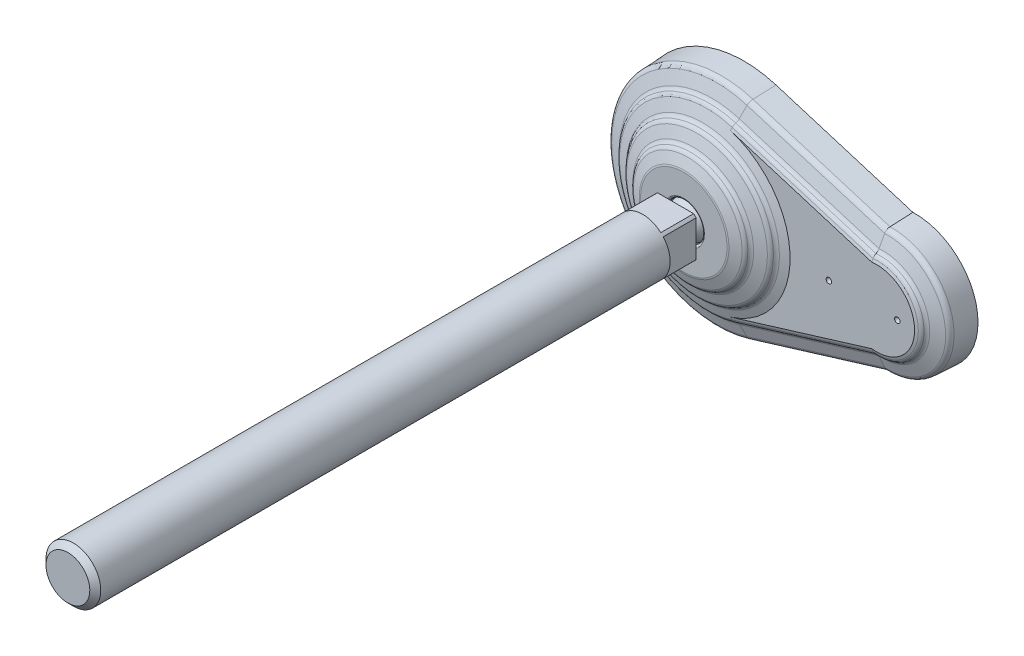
ISO-10303-21;
HEADER;
FILE_DESCRIPTION(('STEP AP214'),'2;1');
FILE_NAME('part.step','',(''),(''),'','','');
FILE_SCHEMA(('AUTOMOTIVE_DESIGN { 1 0 10303 214 1 1 1 1 }'));
ENDSEC;
DATA;
#1=APPLICATION_CONTEXT('core data for automotive mechanical design processes');
#2=APPLICATION_PROTOCOL_DEFINITION('international standard','automotive_design',2000,#1);
#3=PRODUCT_CONTEXT('',#1,'mechanical');
#4=PRODUCT('Part','Part','',(#3));
#5=PRODUCT_RELATED_PRODUCT_CATEGORY('part','',(#4));
#6=PRODUCT_DEFINITION_FORMATION('','',#4);
#7=PRODUCT_DEFINITION_CONTEXT('part definition',#1,'design');
#8=PRODUCT_DEFINITION('design','',#6,#7);
#9=PRODUCT_DEFINITION_SHAPE('','',#8);
#10=(LENGTH_UNIT() NAMED_UNIT(*) SI_UNIT(.MILLI.,.METRE.));
#11=(NAMED_UNIT(*) PLANE_ANGLE_UNIT() SI_UNIT($,.RADIAN.));
#12=(NAMED_UNIT(*) SI_UNIT($,.STERADIAN.) SOLID_ANGLE_UNIT());
#13=UNCERTAINTY_MEASURE_WITH_UNIT(LENGTH_MEASURE(1.E-05),#10,'distance_accuracy_value','');
#14=(GEOMETRIC_REPRESENTATION_CONTEXT(3) GLOBAL_UNCERTAINTY_ASSIGNED_CONTEXT((#13)) GLOBAL_UNIT_ASSIGNED_CONTEXT((#10,
#11,#12)) REPRESENTATION_CONTEXT('',''));
#15=CARTESIAN_POINT('',(0.,0.,0.));
#16=DIRECTION('',(0.,0.,1.));
#17=DIRECTION('',(1.,0.,0.));
#18=AXIS2_PLACEMENT_3D('',#15,#16,#17);
#19=CARTESIAN_POINT('',(0.,0.,37.));
#20=DIRECTION('',(0.,0.,1.));
#21=DIRECTION('',(-1.,0.,0.));
#22=AXIS2_PLACEMENT_3D('',#19,#20,#21);
#23=CYLINDRICAL_SURFACE('',#22,10.);
#24=CARTESIAN_POINT('',(0.,0.,245.));
#25=DIRECTION('',(0.,0.,1.));
#26=DIRECTION('',(-1.,0.,0.));
#27=AXIS2_PLACEMENT_3D('',#24,#25,#26);
#28=CIRCLE('',#27,10.);
#29=CARTESIAN_POINT('',(-10.,0.,245.));
#30=VERTEX_POINT('',#29);
#31=EDGE_CURVE('E9',#30,#30,#28,.F.);
#32=ORIENTED_EDGE('',*,*,#31,.T.);
#33=EDGE_LOOP('',(#32));
#34=FACE_BOUND('',#33,.T.);
#35=DIRECTION('',(0.,0.,1.));
#36=VECTOR('',#35,1.);
#37=CARTESIAN_POINT('',(-6.61437827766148,-7.5,37.));
#38=LINE('',#37,#36);
#39=CARTESIAN_POINT('',(-6.61437827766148,-7.5,37.));
#40=VERTEX_POINT('',#39);
#41=CARTESIAN_POINT('',(-6.61437827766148,-7.5,25.));
#42=VERTEX_POINT('',#41);
#43=EDGE_CURVE('E135',#40,#42,#38,.F.);
#44=ORIENTED_EDGE('',*,*,#43,.F.);
#45=CARTESIAN_POINT('',(0.,0.,37.));
#46=DIRECTION('',(0.,0.,1.));
#47=DIRECTION('',(0.,-1.,0.));
#48=AXIS2_PLACEMENT_3D('',#45,#46,#47);
#49=CIRCLE('',#48,10.);
#50=CARTESIAN_POINT('',(6.61437827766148,-7.5,37.));
#51=VERTEX_POINT('',#50);
#52=EDGE_CURVE('E506',#40,#51,#49,.T.);
#53=ORIENTED_EDGE('',*,*,#52,.T.);
#54=DIRECTION('',(0.,0.,1.));
#55=VECTOR('',#54,1.);
#56=CARTESIAN_POINT('',(6.61437827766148,-7.5,37.));
#57=LINE('',#56,#55);
#58=CARTESIAN_POINT('',(6.61437827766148,-7.5,25.));
#59=VERTEX_POINT('',#58);
#60=EDGE_CURVE('E200',#59,#51,#57,.T.);
#61=ORIENTED_EDGE('',*,*,#60,.F.);
#62=CARTESIAN_POINT('',(0.,0.,25.));
#63=DIRECTION('',(0.,0.,1.));
#64=DIRECTION('',(-1.,0.,0.));
#65=AXIS2_PLACEMENT_3D('',#62,#63,#64);
#66=CIRCLE('',#65,10.);
#67=CARTESIAN_POINT('',(7.5,-6.61437827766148,25.));
#68=VERTEX_POINT('',#67);
#69=EDGE_CURVE('E183',#59,#68,#66,.T.);
#70=ORIENTED_EDGE('',*,*,#69,.T.);
#71=DIRECTION('',(0.,0.,1.));
#72=VECTOR('',#71,1.);
#73=CARTESIAN_POINT('',(7.5,-6.61437827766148,37.));
#74=LINE('',#73,#72);
#75=CARTESIAN_POINT('',(7.5,-6.61437827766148,37.));
#76=VERTEX_POINT('',#75);
#77=EDGE_CURVE('E197',#76,#68,#74,.F.);
#78=ORIENTED_EDGE('',*,*,#77,.F.);
#79=CARTESIAN_POINT('',(7.5,6.61437827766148,37.));
#80=VERTEX_POINT('',#79);
#81=EDGE_CURVE('E265',#76,#80,#49,.T.);
#82=ORIENTED_EDGE('',*,*,#81,.T.);
#83=DIRECTION('',(0.,0.,1.));
#84=VECTOR('',#83,1.);
#85=CARTESIAN_POINT('',(7.5,6.61437827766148,37.));
#86=LINE('',#85,#84);
#87=CARTESIAN_POINT('',(7.5,6.61437827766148,25.));
#88=VERTEX_POINT('',#87);
#89=EDGE_CURVE('E242',#88,#80,#86,.T.);
#90=ORIENTED_EDGE('',*,*,#89,.F.);
#91=CARTESIAN_POINT('',(6.61437827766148,7.5,25.));
#92=VERTEX_POINT('',#91);
#93=EDGE_CURVE('E179',#88,#92,#66,.T.);
#94=ORIENTED_EDGE('',*,*,#93,.T.);
#95=DIRECTION('',(0.,0.,1.));
#96=VECTOR('',#95,1.);
#97=CARTESIAN_POINT('',(6.61437827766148,7.5,37.));
#98=LINE('',#97,#96);
#99=CARTESIAN_POINT('',(6.61437827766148,7.5,37.));
#100=VERTEX_POINT('',#99);
#101=EDGE_CURVE('E160',#100,#92,#98,.F.);
#102=ORIENTED_EDGE('',*,*,#101,.F.);
#103=CARTESIAN_POINT('',(-6.61437827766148,7.5,37.));
#104=VERTEX_POINT('',#103);
#105=EDGE_CURVE('E173',#100,#104,#49,.T.);
#106=ORIENTED_EDGE('',*,*,#105,.T.);
#107=DIRECTION('',(0.,0.,1.));
#108=VECTOR('',#107,1.);
#109=CARTESIAN_POINT('',(-6.61437827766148,7.5,37.));
#110=LINE('',#109,#108);
#111=CARTESIAN_POINT('',(-6.61437827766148,7.5,25.));
#112=VERTEX_POINT('',#111);
#113=EDGE_CURVE('E158',#112,#104,#110,.T.);
#114=ORIENTED_EDGE('',*,*,#113,.F.);
#115=CARTESIAN_POINT('',(-7.5,6.61437827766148,25.));
#116=VERTEX_POINT('',#115);
#117=EDGE_CURVE('E171',#112,#116,#66,.T.);
#118=ORIENTED_EDGE('',*,*,#117,.T.);
#119=DIRECTION('',(0.,0.,1.));
#120=VECTOR('',#119,1.);
#121=CARTESIAN_POINT('',(-7.5,6.61437827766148,37.));
#122=LINE('',#121,#120);
#123=CARTESIAN_POINT('',(-7.5,6.61437827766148,37.));
#124=VERTEX_POINT('',#123);
#125=EDGE_CURVE('E174',#124,#116,#122,.F.);
#126=ORIENTED_EDGE('',*,*,#125,.F.);
#127=CARTESIAN_POINT('',(-7.5,-6.61437827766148,37.));
#128=VERTEX_POINT('',#127);
#129=EDGE_CURVE('E516',#124,#128,#49,.T.);
#130=ORIENTED_EDGE('',*,*,#129,.T.);
#131=DIRECTION('',(0.,0.,1.));
#132=VECTOR('',#131,1.);
#133=CARTESIAN_POINT('',(-7.5,-6.61437827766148,37.));
#134=LINE('',#133,#132);
#135=CARTESIAN_POINT('',(-7.5,-6.61437827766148,25.));
#136=VERTEX_POINT('',#135);
#137=EDGE_CURVE('E180',#136,#128,#134,.T.);
#138=ORIENTED_EDGE('',*,*,#137,.F.);
#139=EDGE_CURVE('E182',#136,#42,#66,.T.);
#140=ORIENTED_EDGE('',*,*,#139,.T.);
#141=EDGE_LOOP('',(#44,#53,#61,#70,#78,#82,#90,#94,#102,#106,#114,#118,#126,#130,#138,#140));
#142=FACE_BOUND('',#141,.T.);
#143=ADVANCED_FACE('F14',(#34,#142),#23,.T.);
#144=CARTESIAN_POINT('',(-5.26544933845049,0.,25.));
#145=DIRECTION('',(0.,0.,1.));
#146=DIRECTION('',(-1.,0.,0.));
#147=AXIS2_PLACEMENT_3D('',#144,#145,#146);
#148=PLANE('',#147);
#149=DIRECTION('',(0.,-1.,0.));
#150=VECTOR('',#149,1.);
#151=CARTESIAN_POINT('',(-7.5,7.5,25.));
#152=LINE('',#151,#150);
#153=EDGE_CURVE('E31',#116,#136,#152,.T.);
#154=ORIENTED_EDGE('',*,*,#153,.F.);
#155=ORIENTED_EDGE('',*,*,#117,.F.);
#156=DIRECTION('',(-1.,0.,0.));
#157=VECTOR('',#156,1.);
#158=CARTESIAN_POINT('',(7.5,7.5,25.));
#159=LINE('',#158,#157);
#160=EDGE_CURVE('E153',#92,#112,#159,.T.);
#161=ORIENTED_EDGE('',*,*,#160,.F.);
#162=ORIENTED_EDGE('',*,*,#93,.F.);
#163=DIRECTION('',(0.,1.,0.));
#164=VECTOR('',#163,1.);
#165=CARTESIAN_POINT('',(7.5,-7.5,25.));
#166=LINE('',#165,#164);
#167=EDGE_CURVE('E165',#68,#88,#166,.T.);
#168=ORIENTED_EDGE('',*,*,#167,.F.);
#169=ORIENTED_EDGE('',*,*,#69,.F.);
#170=DIRECTION('',(1.,0.,0.));
#171=VECTOR('',#170,1.);
#172=CARTESIAN_POINT('',(-7.5,-7.5,25.));
#173=LINE('',#172,#171);
#174=EDGE_CURVE('E202',#42,#59,#173,.T.);
#175=ORIENTED_EDGE('',*,*,#174,.F.);
#176=ORIENTED_EDGE('',*,*,#139,.F.);
#177=EDGE_LOOP('',(#154,#155,#161,#162,#168,#169,#175,#176));
#178=FACE_BOUND('',#177,.T.);
#179=CARTESIAN_POINT('',(0.,0.,25.));
#180=DIRECTION('',(0.,0.,1.));
#181=DIRECTION('',(-1.,0.,0.));
#182=AXIS2_PLACEMENT_3D('',#179,#180,#181);
#183=CIRCLE('',#182,5.26544933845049);
#184=CARTESIAN_POINT('',(-5.26544933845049,0.,25.));
#185=VERTEX_POINT('',#184);
#186=EDGE_CURVE('E188',#185,#185,#183,.T.);
#187=ORIENTED_EDGE('',*,*,#186,.T.);
#188=EDGE_LOOP('',(#187));
#189=FACE_BOUND('',#188,.T.);
#190=ADVANCED_FACE('F176',(#178,#189),#148,.F.);
#191=CARTESIAN_POINT('',(0.,0.,18.6509999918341));
#192=DIRECTION('',(0.,0.,1.));
#193=DIRECTION('',(-1.,0.,0.));
#194=AXIS2_PLACEMENT_3D('',#191,#192,#193);
#195=DEGENERATE_TOROIDAL_SURFACE('',#194,0.000333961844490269,6.829,.T.);
#196=CARTESIAN_POINT('',(0.,0.,19.794));
#197=DIRECTION('',(0.,0.,-1.));
#198=DIRECTION('',(1.,0.,0.));
#199=AXIS2_PLACEMENT_3D('',#196,#197,#198);
#200=CIRCLE('',#199,6.733);
#201=CARTESIAN_POINT('',(6.733,0.,19.794));
#202=VERTEX_POINT('',#201);
#203=EDGE_CURVE('E249',#202,#202,#200,.T.);
#204=ORIENTED_EDGE('',*,*,#203,.F.);
#205=EDGE_LOOP('',(#204));
#206=FACE_BOUND('',#205,.T.);
#207=CARTESIAN_POINT('',(0.,0.,23.));
#208=DIRECTION('',(0.,0.,1.));
#209=DIRECTION('',(-1.,0.,0.));
#210=AXIS2_PLACEMENT_3D('',#207,#208,#209);
#211=CIRCLE('',#210,5.26544933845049);
#212=CARTESIAN_POINT('',(-5.26544933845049,0.,23.));
#213=VERTEX_POINT('',#212);
#214=EDGE_CURVE('E190',#213,#213,#211,.T.);
#215=ORIENTED_EDGE('',*,*,#214,.F.);
#216=EDGE_LOOP('',(#215));
#217=FACE_BOUND('',#216,.T.);
#218=ADVANCED_FACE('F450',(#206,#217),#195,.T.);
#219=CARTESIAN_POINT('',(0.,0.,37.));
#220=DIRECTION('',(0.,0.,1.));
#221=DIRECTION('',(-1.,0.,0.));
#222=AXIS2_PLACEMENT_3D('',#219,#220,#221);
#223=CYLINDRICAL_SURFACE('',#222,5.26544933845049);
#224=ORIENTED_EDGE('',*,*,#186,.F.);
#225=EDGE_LOOP('',(#224));
#226=FACE_BOUND('',#225,.T.);
#227=ORIENTED_EDGE('',*,*,#214,.T.);
#228=EDGE_LOOP('',(#227));
#229=FACE_BOUND('',#228,.T.);
#230=ADVANCED_FACE('F529',(#226,#229),#223,.T.);
#231=CARTESIAN_POINT('',(-7.5,-7.5,25.));
#232=DIRECTION('',(0.,-1.,0.));
#233=DIRECTION('',(1.,0.,0.));
#234=AXIS2_PLACEMENT_3D('',#231,#232,#233);
#235=PLANE('',#234);
#236=ORIENTED_EDGE('',*,*,#60,.T.);
#237=DIRECTION('',(-1.,0.,0.));
#238=VECTOR('',#237,1.);
#239=CARTESIAN_POINT('',(-10.,-7.5,37.));
#240=LINE('',#239,#238);
#241=EDGE_CURVE('E214',#51,#40,#240,.T.);
#242=ORIENTED_EDGE('',*,*,#241,.T.);
#243=ORIENTED_EDGE('',*,*,#43,.T.);
#244=ORIENTED_EDGE('',*,*,#174,.T.);
#245=EDGE_LOOP('',(#236,#242,#243,#244));
#246=FACE_BOUND('',#245,.T.);
#247=ADVANCED_FACE('F525',(#246),#235,.T.);
#248=CARTESIAN_POINT('',(7.5,-7.5,25.));
#249=DIRECTION('',(1.,0.,0.));
#250=DIRECTION('',(0.,1.,0.));
#251=AXIS2_PLACEMENT_3D('',#248,#249,#250);
#252=PLANE('',#251);
#253=ORIENTED_EDGE('',*,*,#89,.T.);
#254=DIRECTION('',(0.,-1.,0.));
#255=VECTOR('',#254,1.);
#256=CARTESIAN_POINT('',(7.5,0.,37.));
#257=LINE('',#256,#255);
#258=EDGE_CURVE('E221',#80,#76,#257,.T.);
#259=ORIENTED_EDGE('',*,*,#258,.T.);
#260=ORIENTED_EDGE('',*,*,#77,.T.);
#261=ORIENTED_EDGE('',*,*,#167,.T.);
#262=EDGE_LOOP('',(#253,#259,#260,#261));
#263=FACE_BOUND('',#262,.T.);
#264=ADVANCED_FACE('F540',(#263),#252,.T.);
#265=CARTESIAN_POINT('',(7.5,7.5,25.));
#266=DIRECTION('',(0.,1.,0.));
#267=DIRECTION('',(-1.,0.,0.));
#268=AXIS2_PLACEMENT_3D('',#265,#266,#267);
#269=PLANE('',#268);
#270=ORIENTED_EDGE('',*,*,#113,.T.);
#271=DIRECTION('',(1.,0.,0.));
#272=VECTOR('',#271,1.);
#273=CARTESIAN_POINT('',(-10.,7.5,37.));
#274=LINE('',#273,#272);
#275=EDGE_CURVE('E225',#104,#100,#274,.T.);
#276=ORIENTED_EDGE('',*,*,#275,.T.);
#277=ORIENTED_EDGE('',*,*,#101,.T.);
#278=ORIENTED_EDGE('',*,*,#160,.T.);
#279=EDGE_LOOP('',(#270,#276,#277,#278));
#280=FACE_BOUND('',#279,.T.);
#281=ADVANCED_FACE('F155',(#280),#269,.T.);
#282=CARTESIAN_POINT('',(-7.5,7.5,25.));
#283=DIRECTION('',(-1.,0.,0.));
#284=DIRECTION('',(0.,-1.,0.));
#285=AXIS2_PLACEMENT_3D('',#282,#283,#284);
#286=PLANE('',#285);
#287=ORIENTED_EDGE('',*,*,#137,.T.);
#288=DIRECTION('',(0.,1.,0.));
#289=VECTOR('',#288,1.);
#290=CARTESIAN_POINT('',(-7.5,0.,37.));
#291=LINE('',#290,#289);
#292=EDGE_CURVE('E238',#128,#124,#291,.T.);
#293=ORIENTED_EDGE('',*,*,#292,.T.);
#294=ORIENTED_EDGE('',*,*,#125,.T.);
#295=ORIENTED_EDGE('',*,*,#153,.T.);
#296=EDGE_LOOP('',(#287,#293,#294,#295));
#297=FACE_BOUND('',#296,.T.);
#298=ADVANCED_FACE('F461',(#297),#286,.T.);
#299=CARTESIAN_POINT('',(62.5,0.,0.));
#300=DIRECTION('',(0.,0.,-1.));
#301=DIRECTION('',(0.,1.,0.));
#302=AXIS2_PLACEMENT_3D('',#299,#300,#301);
#303=CONICAL_SURFACE('',#302,22.9787234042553,0.0523365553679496);
#304=CARTESIAN_POINT('',(62.5,0.,8.30411735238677));
#305=DIRECTION('',(0.,0.,1.));
#306=DIRECTION('',(0.,-1.,0.));
#307=AXIS2_PLACEMENT_3D('',#304,#305,#306);
#308=CIRCLE('',#307,22.5437172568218);
#309=CARTESIAN_POINT('',(61.6407011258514,-22.5273343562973,8.30411735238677));
#310=VERTEX_POINT('',#309);
#311=CARTESIAN_POINT('',(61.6407011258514,22.5273343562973,8.30411735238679));
#312=VERTEX_POINT('',#311);
#313=EDGE_CURVE('E284',#310,#312,#308,.T.);
#314=ORIENTED_EDGE('',*,*,#313,.F.);
#315=CARTESIAN_POINT('',(61.6406997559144,-22.5273238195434,8.30431735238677));
#316=CARTESIAN_POINT('',(61.6501805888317,-22.600242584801,6.92023165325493));
#317=CARTESIAN_POINT('',(61.6596900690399,-22.6731526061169,5.53614569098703));
#318=CARTESIAN_POINT('',(61.6787663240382,-22.8189551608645,2.76797324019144));
#319=CARTESIAN_POINT('',(61.6883330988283,-22.8918476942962,1.38388675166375));
#320=CARTESIAN_POINT('',(61.6979285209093,-22.9647314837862,-0.00020000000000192));
#321=B_SPLINE_CURVE_WITH_KNOTS('',3,(#315,#316,#317,#318,#319,#320),.UNSPECIFIED.,.F.,.F.,(4,2,
4),(0.,4.15811282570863,8.31622565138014),.UNSPECIFIED.);
#322=CARTESIAN_POINT('',(61.697927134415,-22.9647209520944,0.));
#323=VERTEX_POINT('',#322);
#324=EDGE_CURVE('E691',#310,#323,#321,.T.);
#325=ORIENTED_EDGE('',*,*,#324,.T.);
#326=CARTESIAN_POINT('',(62.5,0.,0.));
#327=DIRECTION('',(0.,0.,1.));
#328=DIRECTION('',(0.,-1.,0.));
#329=AXIS2_PLACEMENT_3D('',#326,#327,#328);
#330=CIRCLE('',#329,22.9787234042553);
#331=CARTESIAN_POINT('',(61.6979271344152,22.9647209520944,0.));
#332=VERTEX_POINT('',#331);
#333=EDGE_CURVE('E286',#323,#332,#330,.T.);
#334=ORIENTED_EDGE('',*,*,#333,.T.);
#335=CARTESIAN_POINT('',(61.6979285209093,22.9647314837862,-0.00019999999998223));
#336=CARTESIAN_POINT('',(61.6883330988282,22.8918476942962,1.38388675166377));
#337=CARTESIAN_POINT('',(61.6787663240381,22.8189551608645,2.76797324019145));
#338=CARTESIAN_POINT('',(61.6596900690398,22.6731526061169,5.53614569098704));
#339=CARTESIAN_POINT('',(61.6501805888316,22.600242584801,6.92023165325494));
#340=CARTESIAN_POINT('',(61.6406997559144,22.5273238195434,8.30431735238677));
#341=B_SPLINE_CURVE_WITH_KNOTS('',3,(#335,#336,#337,#338,#339,#340),.UNSPECIFIED.,.F.,.F.,(4,2,
4),(0.,4.1581128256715,8.31622565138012),.UNSPECIFIED.);
#342=EDGE_CURVE('E700',#332,#312,#341,.T.);
#343=ORIENTED_EDGE('',*,*,#342,.T.);
#344=EDGE_LOOP('',(#314,#325,#334,#343));
#345=FACE_BOUND('',#344,.T.);
#346=ADVANCED_FACE('F455',(#345),#303,.T.);
#347=CARTESIAN_POINT('',(64.1644462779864,-21.755748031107,8.30411735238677));
#348=DIRECTION('',(-0.291971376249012,0.9549953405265,-0.0523126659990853));
#349=DIRECTION('',(-0.956304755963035,-0.292371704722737,0.));
#350=AXIS2_PLACEMENT_3D('',#347,#348,#349);
#351=PLANE('',#350);
#352=ORIENTED_EDGE('',*,*,#324,.F.);
#353=DIRECTION('',(-0.956304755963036,-0.292371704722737,0.));
#354=VECTOR('',#353,1.);
#355=CARTESIAN_POINT('',(64.1644462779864,-21.755748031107,8.30411735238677));
#356=LINE('',#355,#354);
#357=CARTESIAN_POINT('',(11.5676847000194,-37.8361917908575,8.30411735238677));
#358=VERTEX_POINT('',#357);
#359=EDGE_CURVE('E620',#310,#358,#356,.T.);
#360=ORIENTED_EDGE('',*,*,#359,.T.);
#361=DIRECTION('',(-0.0152947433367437,0.050026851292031,0.998630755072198));
#362=VECTOR('',#361,1.);
#363=CARTESIAN_POINT('',(11.6948681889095,-38.2521902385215,0.));
#364=LINE('',#363,#362);
#365=CARTESIAN_POINT('',(11.6948681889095,-38.2521902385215,0.));
#366=VERTEX_POINT('',#365);
#367=EDGE_CURVE('E633',#366,#358,#364,.T.);
#368=ORIENTED_EDGE('',*,*,#367,.F.);
#369=DIRECTION('',(-0.956304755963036,-0.292371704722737,0.));
#370=VECTOR('',#369,1.);
#371=CARTESIAN_POINT('',(64.2916297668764,-22.1717464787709,0.));
#372=LINE('',#371,#370);
#373=EDGE_CURVE('E126',#323,#366,#372,.T.);
#374=ORIENTED_EDGE('',*,*,#373,.F.);
#375=EDGE_LOOP('',(#352,#360,#368,#374));
#376=FACE_BOUND('',#375,.T.);
#377=ADVANCED_FACE('F446',(#376),#351,.F.);
#378=CARTESIAN_POINT('',(0.,0.,0.));
#379=DIRECTION('',(0.,0.,1.));
#380=DIRECTION('',(-1.,0.,0.));
#381=AXIS2_PLACEMENT_3D('',#378,#379,#380);
#382=PLANE('',#381);
#383=DIRECTION('',(-0.956304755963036,0.292371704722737,0.));
#384=VECTOR('',#383,1.);
#385=CARTESIAN_POINT('',(64.2916297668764,22.1717464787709,0.));
#386=LINE('',#385,#384);
#387=CARTESIAN_POINT('',(11.6948681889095,38.2521902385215,0.));
#388=VERTEX_POINT('',#387);
#389=EDGE_CURVE('E618',#332,#388,#386,.T.);
#390=ORIENTED_EDGE('',*,*,#389,.F.);
#391=ORIENTED_EDGE('',*,*,#333,.F.);
#392=ORIENTED_EDGE('',*,*,#373,.T.);
#393=CARTESIAN_POINT('',(0.,0.,0.));
#394=DIRECTION('',(0.,0.,1.));
#395=DIRECTION('',(-1.,0.,0.));
#396=AXIS2_PLACEMENT_3D('',#393,#394,#395);
#397=CIRCLE('',#396,40.);
#398=EDGE_CURVE('E327',#388,#366,#397,.T.);
#399=ORIENTED_EDGE('',*,*,#398,.F.);
#400=EDGE_LOOP('',(#390,#391,#392,#399));
#401=FACE_BOUND('',#400,.T.);
#402=CARTESIAN_POINT('',(45.,0.,0.));
#403=DIRECTION('',(0.,0.,-1.));
#404=DIRECTION('',(0.,1.,0.));
#405=AXIS2_PLACEMENT_3D('',#402,#403,#404);
#406=CIRCLE('',#405,5.25);
#407=CARTESIAN_POINT('',(45.,5.25,0.));
#408=VERTEX_POINT('',#407);
#409=EDGE_CURVE('E503',#408,#408,#406,.T.);
#410=ORIENTED_EDGE('',*,*,#409,.F.);
#411=EDGE_LOOP('',(#410));
#412=FACE_BOUND('',#411,.T.);
#413=CARTESIAN_POINT('',(70.,0.,0.));
#414=DIRECTION('',(0.,0.,-1.));
#415=DIRECTION('',(0.,1.,0.));
#416=AXIS2_PLACEMENT_3D('',#413,#414,#415);
#417=CIRCLE('',#416,5.25);
#418=CARTESIAN_POINT('',(70.,5.25,0.));
#419=VERTEX_POINT('',#418);
#420=EDGE_CURVE('E500',#419,#419,#417,.T.);
#421=ORIENTED_EDGE('',*,*,#420,.F.);
#422=EDGE_LOOP('',(#421));
#423=FACE_BOUND('',#422,.T.);
#424=ADVANCED_FACE('F336',(#401,#412,#423),#382,.F.);
#425=CARTESIAN_POINT('',(64.2916297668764,22.1717464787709,0.));
#426=DIRECTION('',(-0.291971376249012,-0.9549953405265,-0.0523126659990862));
#427=DIRECTION('',(0.956304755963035,-0.292371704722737,0.));
#428=AXIS2_PLACEMENT_3D('',#425,#426,#427);
#429=PLANE('',#428);
#430=ORIENTED_EDGE('',*,*,#342,.F.);
#431=ORIENTED_EDGE('',*,*,#389,.T.);
#432=DIRECTION('',(-0.0152947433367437,-0.050026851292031,0.998630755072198));
#433=VECTOR('',#432,1.);
#434=CARTESIAN_POINT('',(11.6948681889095,38.2521902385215,0.));
#435=LINE('',#434,#433);
#436=CARTESIAN_POINT('',(11.5676847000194,37.8361917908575,8.30411735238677));
#437=VERTEX_POINT('',#436);
#438=EDGE_CURVE('E651',#388,#437,#435,.T.);
#439=ORIENTED_EDGE('',*,*,#438,.T.);
#440=DIRECTION('',(-0.956304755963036,0.292371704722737,0.));
#441=VECTOR('',#440,1.);
#442=CARTESIAN_POINT('',(64.1644462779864,21.755748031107,8.30411735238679));
#443=LINE('',#442,#441);
#444=EDGE_CURVE('E616',#312,#437,#443,.T.);
#445=ORIENTED_EDGE('',*,*,#444,.F.);
#446=EDGE_LOOP('',(#430,#431,#439,#445));
#447=FACE_BOUND('',#446,.T.);
#448=ADVANCED_FACE('F416',(#447),#429,.F.);
#449=CARTESIAN_POINT('',(62.5,0.,8.19912580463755));
#450=DIRECTION('',(0.,0.,1.));
#451=DIRECTION('',(0.,-1.,0.));
#452=AXIS2_PLACEMENT_3D('',#449,#450,#451);
#453=TOROIDAL_SURFACE('',#452,20.5394653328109,2.007);
#454=CARTESIAN_POINT('',(61.6407233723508,-22.5275054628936,8.09743405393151));
#455=CARTESIAN_POINT('',(61.6409510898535,-22.5292569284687,8.13179934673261));
#456=CARTESIAN_POINT('',(61.6410635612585,-22.5301219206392,8.16619641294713));
#457=CARTESIAN_POINT('',(61.6410572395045,-22.5300732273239,8.23504586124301));
#458=CARTESIAN_POINT('',(61.6409380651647,-22.5291566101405,8.26949824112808));
#459=CARTESIAN_POINT('',(61.6399396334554,-22.5214778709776,8.41537858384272));
#460=CARTESIAN_POINT('',(61.6379561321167,-22.5062239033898,8.52649092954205));
#461=CARTESIAN_POINT('',(61.6316126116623,-22.4573679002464,8.74462326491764));
#462=CARTESIAN_POINT('',(61.6272490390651,-22.4237384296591,8.85163687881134));
#463=CARTESIAN_POINT('',(61.6163034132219,-22.339189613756,9.05835724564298));
#464=CARTESIAN_POINT('',(61.6097238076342,-22.2882893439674,9.1580719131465));
#465=CARTESIAN_POINT('',(61.5945702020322,-22.1707054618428,9.34754679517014));
#466=CARTESIAN_POINT('',(61.5859960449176,-22.1040206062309,9.43730622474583));
#467=CARTESIAN_POINT('',(61.5670698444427,-21.9562760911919,9.60507832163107));
#468=CARTESIAN_POINT('',(61.5567047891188,-21.8751110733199,9.68299656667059));
#469=CARTESIAN_POINT('',(61.5345911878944,-21.7011851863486,9.82410142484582));
#470=CARTESIAN_POINT('',(61.5228449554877,-21.6084436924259,9.88731215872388));
#471=CARTESIAN_POINT('',(61.5046129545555,-21.4637836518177,9.96928669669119));
#472=CARTESIAN_POINT('',(61.4985079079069,-21.4152343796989,9.99425235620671));
#473=CARTESIAN_POINT('',(61.4860940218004,-21.3162718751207,10.0401972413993));
#474=CARTESIAN_POINT('',(61.4797850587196,-21.2658575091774,10.0611739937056));
#475=CARTESIAN_POINT('',(61.4596293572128,-21.1043762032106,10.1208327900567));
#476=CARTESIAN_POINT('',(61.4454888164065,-20.9904779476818,10.1519983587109));
#477=CARTESIAN_POINT('',(61.4169436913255,-20.7591475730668,10.1941665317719));
#478=CARTESIAN_POINT('',(61.4025394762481,-20.6417202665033,10.2051954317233));
#479=CARTESIAN_POINT('',(61.3876252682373,-20.5193667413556,10.2061070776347));
#480=CARTESIAN_POINT('',(61.3870090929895,-20.5143103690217,10.2061258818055));
#481=CARTESIAN_POINT('',(61.3863931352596,-20.5092543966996,10.2061258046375));
#482=B_SPLINE_CURVE_WITH_KNOTS('',3,(#454,#455,#456,#457,#458,#459,#460,#461,#462,#463,#464,
#465,#466,#467,#468,#469,#470,#471,#472,#473,#474,#475,#476,#477,#478,#479,#480,#481),
.UNSPECIFIED.,.F.,.F.,(4,2,2,2,2,2,2,2,2,2,2,2,2,4),(0.,0.103191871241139,0.20655369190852,
0.54127575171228,0.87649892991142,1.21135305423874,1.54623356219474,1.88365820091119,
2.2205254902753,2.38517216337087,2.54992059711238,2.90486008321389,3.2593357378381,
3.2746170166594),.UNSPECIFIED.);
#483=CARTESIAN_POINT('',(61.4734629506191,-21.2152067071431,10.0798866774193));
#484=VERTEX_POINT('',#483);
#485=EDGE_CURVE('E693',#310,#484,#482,.T.);
#486=ORIENTED_EDGE('',*,*,#485,.F.);
#487=ORIENTED_EDGE('',*,*,#313,.T.);
#488=CARTESIAN_POINT('',(61.3863931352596,20.5092543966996,10.2061258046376));
#489=CARTESIAN_POINT('',(61.3870091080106,20.5143104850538,10.2061258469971));
#490=CARTESIAN_POINT('',(61.3876252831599,20.5193668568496,10.206107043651));
#491=CARTESIAN_POINT('',(61.3988855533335,20.6117442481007,10.2054193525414));
#492=CARTESIAN_POINT('',(61.4095840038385,20.6991031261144,10.1991511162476));
#493=CARTESIAN_POINT('',(61.4308936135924,20.8723273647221,10.1754412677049));
#494=CARTESIAN_POINT('',(61.4415047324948,20.9581920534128,10.1579947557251));
#495=CARTESIAN_POINT('',(61.4555813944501,21.0716202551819,10.1272225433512));
#496=CARTESIAN_POINT('',(61.4591730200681,21.1005182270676,10.1186877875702));
#497=CARTESIAN_POINT('',(61.4663157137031,21.1579059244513,10.1003430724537));
#498=CARTESIAN_POINT('',(61.4698667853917,21.1863956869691,10.090533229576));
#499=CARTESIAN_POINT('',(61.4866782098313,21.3210820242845,10.0407628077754));
#500=CARTESIAN_POINT('',(61.4996430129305,21.4243838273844,9.99241683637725));
#501=CARTESIAN_POINT('',(61.5245148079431,21.6216549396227,9.87891981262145));
#502=CARTESIAN_POINT('',(61.5364193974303,21.7156031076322,9.81373183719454));
#503=CARTESIAN_POINT('',(61.5587594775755,21.8912250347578,9.66834297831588));
#504=CARTESIAN_POINT('',(61.5691956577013,21.9729045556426,9.58814918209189));
#505=CARTESIAN_POINT('',(61.5882470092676,22.1215501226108,9.41495435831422));
#506=CARTESIAN_POINT('',(61.5968625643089,22.1885192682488,9.32195603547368));
#507=CARTESIAN_POINT('',(61.6119005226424,22.3051440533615,9.12674801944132));
#508=CARTESIAN_POINT('',(61.6183432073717,22.3549598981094,9.02463544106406));
#509=CARTESIAN_POINT('',(61.6289130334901,22.4365717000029,8.81343456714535));
#510=CARTESIAN_POINT('',(61.6330436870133,22.4683949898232,8.70435713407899));
#511=CARTESIAN_POINT('',(61.6371976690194,22.5003783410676,8.54571963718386));
#512=CARTESIAN_POINT('',(61.6382205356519,22.5082502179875,8.49762935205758));
#513=CARTESIAN_POINT('',(61.639806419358,22.5204527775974,8.40103137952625));
#514=CARTESIAN_POINT('',(61.6403698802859,22.52478687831,8.35252414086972));
#515=CARTESIAN_POINT('',(61.6411729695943,22.5309631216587,8.23516417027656));
#516=CARTESIAN_POINT('',(61.641181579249,22.5310278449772,8.16621181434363));
#517=CARTESIAN_POINT('',(61.6407233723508,22.5275054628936,8.09743405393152));
#518=B_SPLINE_CURVE_WITH_KNOTS('',3,(#488,#489,#490,#491,#492,#493,#494,#495,#496,#497,#498,
#499,#500,#501,#502,#503,#504,#505,#506,#507,#508,#509,#510,#511,#512,#513,#514,#515,#516,#517),
.UNSPECIFIED.,.F.,.F.,(4,2,2,2,2,2,2,2,2,2,2,2,2,2,4),(0.,0.0152812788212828,0.27917431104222,
0.543183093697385,0.634194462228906,0.725197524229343,1.06775959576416,1.41107914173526,
1.75423694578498,2.09732237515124,2.43711059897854,2.77638125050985,2.92250118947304,
3.06847978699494,3.27496314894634),.UNSPECIFIED.);
#519=CARTESIAN_POINT('',(61.4734629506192,21.2152067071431,10.0798866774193));
#520=VERTEX_POINT('',#519);
#521=EDGE_CURVE('E405',#520,#312,#518,.T.);
#522=ORIENTED_EDGE('',*,*,#521,.F.);
#523=CARTESIAN_POINT('',(62.5,0.,10.0798866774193));
#524=DIRECTION('',(0.,0.,1.));
#525=DIRECTION('',(0.,-1.,0.));
#526=AXIS2_PLACEMENT_3D('',#523,#524,#525);
#527=CIRCLE('',#526,21.2400276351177);
#528=EDGE_CURVE('E282',#484,#520,#527,.T.);
#529=ORIENTED_EDGE('',*,*,#528,.F.);
#530=EDGE_LOOP('',(#486,#487,#522,#529));
#531=FACE_BOUND('',#530,.T.);
#532=ADVANCED_FACE('F387',(#531),#453,.T.);
#533=CARTESIAN_POINT('',(63.5784597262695,-19.8390723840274,8.19912580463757));
#534=DIRECTION('',(-0.956304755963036,-0.292371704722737,0.));
#535=DIRECTION('',(0.292371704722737,-0.956304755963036,0.));
#536=AXIS2_PLACEMENT_3D('',#533,#534,#535);
#537=CYLINDRICAL_SURFACE('',#536,2.00699999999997);
#538=ORIENTED_EDGE('',*,*,#359,.F.);
#539=ORIENTED_EDGE('',*,*,#485,.T.);
#540=DIRECTION('',(-0.956304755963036,-0.292371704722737,0.));
#541=VECTOR('',#540,1.);
#542=CARTESIAN_POINT('',(63.7832843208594,-20.5090234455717,10.0798866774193));
#543=LINE('',#542,#541);
#544=CARTESIAN_POINT('',(11.1865227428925,-36.5894672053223,10.0798866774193));
#545=VERTEX_POINT('',#544);
#546=EDGE_CURVE('E622',#484,#545,#543,.T.);
#547=ORIENTED_EDGE('',*,*,#546,.T.);
#548=CARTESIAN_POINT('',(10.9816981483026,-35.9195161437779,8.19912580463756));
#549=DIRECTION('',(0.956304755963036,0.292371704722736,0.));
#550=DIRECTION('',(-0.292371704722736,0.956304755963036,0.));
#551=AXIS2_PLACEMENT_3D('',#548,#549,#550);
#552=CIRCLE('',#551,2.007);
#553=EDGE_CURVE('E636',#545,#358,#552,.T.);
#554=ORIENTED_EDGE('',*,*,#553,.T.);
#555=EDGE_LOOP('',(#538,#539,#547,#554));
#556=FACE_BOUND('',#555,.T.);
#557=ADVANCED_FACE('F417',(#556),#537,.T.);
#558=CARTESIAN_POINT('',(0.,0.,0.));
#559=DIRECTION('',(0.,0.,-1.));
#560=DIRECTION('',(1.,0.,0.));
#561=AXIS2_PLACEMENT_3D('',#558,#559,#560);
#562=CONICAL_SURFACE('',#561,40.,0.0523365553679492);
#563=CARTESIAN_POINT('',(0.,0.,8.30411735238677));
#564=DIRECTION('',(0.,0.,1.));
#565=DIRECTION('',(-1.,0.,0.));
#566=AXIS2_PLACEMENT_3D('',#563,#564,#565);
#567=CIRCLE('',#566,39.5649938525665);
#568=EDGE_CURVE('E680',#437,#358,#567,.T.);
#569=ORIENTED_EDGE('',*,*,#568,.F.);
#570=ORIENTED_EDGE('',*,*,#438,.F.);
#571=ORIENTED_EDGE('',*,*,#398,.T.);
#572=ORIENTED_EDGE('',*,*,#367,.T.);
#573=EDGE_LOOP('',(#569,#570,#571,#572));
#574=FACE_BOUND('',#573,.T.);
#575=ADVANCED_FACE('F437',(#574),#562,.T.);
#576=CARTESIAN_POINT('',(63.5784597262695,19.8390723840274,8.1991258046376));
#577=DIRECTION('',(-0.956304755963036,0.292371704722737,0.));
#578=DIRECTION('',(-0.292371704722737,-0.956304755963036,0.));
#579=AXIS2_PLACEMENT_3D('',#576,#577,#578);
#580=CYLINDRICAL_SURFACE('',#579,2.00699999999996);
#581=DIRECTION('',(-0.956304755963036,0.292371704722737,0.));
#582=VECTOR('',#581,1.);
#583=CARTESIAN_POINT('',(63.7832843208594,20.5090234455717,10.0798866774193));
#584=LINE('',#583,#582);
#585=CARTESIAN_POINT('',(11.1865227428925,36.5894672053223,10.0798866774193));
#586=VERTEX_POINT('',#585);
#587=EDGE_CURVE('E614',#520,#586,#584,.T.);
#588=ORIENTED_EDGE('',*,*,#587,.F.);
#589=ORIENTED_EDGE('',*,*,#521,.T.);
#590=ORIENTED_EDGE('',*,*,#444,.T.);
#591=CARTESIAN_POINT('',(10.9816981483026,35.9195161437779,8.19912580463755));
#592=DIRECTION('',(-0.956304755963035,0.292371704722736,0.));
#593=DIRECTION('',(-0.292371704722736,-0.956304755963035,0.));
#594=AXIS2_PLACEMENT_3D('',#591,#592,#593);
#595=CIRCLE('',#594,2.007);
#596=EDGE_CURVE('E654',#586,#437,#595,.T.);
#597=ORIENTED_EDGE('',*,*,#596,.F.);
#598=EDGE_LOOP('',(#588,#589,#590,#597));
#599=FACE_BOUND('',#598,.T.);
#600=ADVANCED_FACE('F345',(#599),#580,.T.);
#601=CARTESIAN_POINT('',(62.5,0.,10.0798866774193));
#602=DIRECTION('',(0.,0.,-1.));
#603=DIRECTION('',(0.,1.,0.));
#604=AXIS2_PLACEMENT_3D('',#601,#602,#603);
#605=CONICAL_SURFACE('',#604,21.2400276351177,1.21422909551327);
#606=CARTESIAN_POINT('',(62.5,0.,11.656251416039));
#607=DIRECTION('',(0.,0.,1.));
#608=DIRECTION('',(0.,-1.,0.));
#609=AXIS2_PLACEMENT_3D('',#606,#607,#608);
#610=CIRCLE('',#609,17.0080484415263);
#611=CARTESIAN_POINT('',(60.9818619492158,-16.9401584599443,11.656251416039));
#612=VERTEX_POINT('',#611);
#613=CARTESIAN_POINT('',(60.9818619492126,16.9401584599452,11.656251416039));
#614=VERTEX_POINT('',#613);
#615=EDGE_CURVE('E280',#612,#614,#610,.T.);
#616=ORIENTED_EDGE('',*,*,#615,.F.);
#617=CARTESIAN_POINT('',(60.9818053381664,-16.9396143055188,11.656451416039));
#618=CARTESIAN_POINT('',(61.0189355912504,-17.2964789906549,11.5252879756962));
#619=CARTESIAN_POINT('',(61.0571375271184,-17.653206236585,11.3940567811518));
#620=CARTESIAN_POINT('',(61.1355151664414,-18.3663907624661,11.1314756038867));
#621=CARTESIAN_POINT('',(61.1756908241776,-18.7228480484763,11.0001256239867));
#622=CARTESIAN_POINT('',(61.2578477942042,-19.435511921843,10.7373183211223));
#623=CARTESIAN_POINT('',(61.2998290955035,-19.7917185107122,10.6058609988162));
#624=CARTESIAN_POINT('',(61.3854616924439,-20.5039033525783,10.3428458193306));
#625=CARTESIAN_POINT('',(61.4291130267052,-20.8598816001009,10.2112879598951));
#626=CARTESIAN_POINT('',(61.4735304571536,-21.2157475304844,10.0796866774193));
#627=B_SPLINE_CURVE_WITH_KNOTS('',3,(#617,#618,#619,#620,#621,#622,#623,#624,#625,#626),
.UNSPECIFIED.,.F.,.F.,(4,2,2,2,4),(0.,1.14603990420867,2.29205327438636,3.43805966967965,
4.58409258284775),.UNSPECIFIED.);
#628=EDGE_CURVE('E397',#612,#484,#627,.T.);
#629=ORIENTED_EDGE('',*,*,#628,.T.);
#630=ORIENTED_EDGE('',*,*,#528,.T.);
#631=CARTESIAN_POINT('',(61.4735304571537,21.2157475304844,10.0796866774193));
#632=CARTESIAN_POINT('',(61.4291130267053,20.8598816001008,10.2112879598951));
#633=CARTESIAN_POINT('',(61.3854616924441,20.5039033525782,10.3428458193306));
#634=CARTESIAN_POINT('',(61.2998290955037,19.7917185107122,10.6058609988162));
#635=CARTESIAN_POINT('',(61.2578477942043,19.435511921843,10.7373183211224));
#636=CARTESIAN_POINT('',(61.1756908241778,18.7228480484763,11.0001256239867));
#637=CARTESIAN_POINT('',(61.1355151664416,18.3663907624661,11.1314756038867));
#638=CARTESIAN_POINT('',(61.0571375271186,17.653206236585,11.3940567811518));
#639=CARTESIAN_POINT('',(61.0189355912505,17.2964789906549,11.5252879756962));
#640=CARTESIAN_POINT('',(60.9818053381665,16.9396143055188,11.656451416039));
#641=B_SPLINE_CURVE_WITH_KNOTS('',3,(#631,#632,#633,#634,#635,#636,#637,#638,#639,#640),
.UNSPECIFIED.,.F.,.F.,(4,2,2,2,4),(0.,1.1460329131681,2.29203930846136,3.43805267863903,
4.58409258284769),.UNSPECIFIED.);
#642=EDGE_CURVE('E391',#520,#614,#641,.T.);
#643=ORIENTED_EDGE('',*,*,#642,.T.);
#644=EDGE_LOOP('',(#616,#629,#630,#643));
#645=FACE_BOUND('',#644,.T.);
#646=ADVANCED_FACE('F380',(#645),#605,.T.);
#647=CARTESIAN_POINT('',(62.545973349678,-16.4619616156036,11.656251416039));
#648=DIRECTION('',(-0.102055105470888,0.333807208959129,-0.937100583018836));
#649=DIRECTION('',(0.,0.942019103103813,0.335559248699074));
#650=AXIS2_PLACEMENT_3D('',#647,#648,#649);
#651=PLANE('',#650);
#652=ORIENTED_EDGE('',*,*,#628,.F.);
#653=DIRECTION('',(-0.956304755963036,-0.292371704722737,0.));
#654=VECTOR('',#653,1.);
#655=CARTESIAN_POINT('',(62.545973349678,-16.4619616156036,11.656251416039));
#656=LINE('',#655,#654);
#657=CARTESIAN_POINT('',(9.949211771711,-32.5424053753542,11.656251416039));
#658=VERTEX_POINT('',#657);
#659=EDGE_CURVE('E624',#612,#658,#656,.T.);
#660=ORIENTED_EDGE('',*,*,#659,.T.);
#661=DIRECTION('',(-0.273981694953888,0.896153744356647,0.349059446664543));
#662=VECTOR('',#661,1.);
#663=CARTESIAN_POINT('',(11.1865227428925,-36.5894672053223,10.0798866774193));
#664=LINE('',#663,#662);
#665=EDGE_CURVE('E639',#545,#658,#664,.T.);
#666=ORIENTED_EDGE('',*,*,#665,.F.);
#667=ORIENTED_EDGE('',*,*,#546,.F.);
#668=EDGE_LOOP('',(#652,#660,#666,#667));
#669=FACE_BOUND('',#668,.T.);
#670=ADVANCED_FACE('F385',(#669),#651,.F.);
#671=CARTESIAN_POINT('',(0.,0.,8.19912580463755));
#672=DIRECTION('',(0.,0.,1.));
#673=DIRECTION('',(-1.,0.,0.));
#674=AXIS2_PLACEMENT_3D('',#671,#672,#673);
#675=TOROIDAL_SURFACE('',#674,37.5607419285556,2.007);
#676=CARTESIAN_POINT('',(0.,0.,10.0798866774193));
#677=DIRECTION('',(0.,0.,1.));
#678=DIRECTION('',(-1.,0.,0.));
#679=AXIS2_PLACEMENT_3D('',#676,#677,#678);
#680=CIRCLE('',#679,38.2613042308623);
#681=EDGE_CURVE('E678',#586,#545,#680,.T.);
#682=ORIENTED_EDGE('',*,*,#681,.F.);
#683=ORIENTED_EDGE('',*,*,#596,.T.);
#684=ORIENTED_EDGE('',*,*,#568,.T.);
#685=ORIENTED_EDGE('',*,*,#553,.F.);
#686=EDGE_LOOP('',(#682,#683,#684,#685));
#687=FACE_BOUND('',#686,.T.);
#688=ADVANCED_FACE('F414',(#687),#675,.T.);
#689=CARTESIAN_POINT('',(63.7832843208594,20.5090234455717,10.0798866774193));
#690=DIRECTION('',(-0.102055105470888,-0.333807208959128,-0.937100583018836));
#691=DIRECTION('',(0.,0.942019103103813,-0.335559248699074));
#692=AXIS2_PLACEMENT_3D('',#689,#690,#691);
#693=PLANE('',#692);
#694=ORIENTED_EDGE('',*,*,#642,.F.);
#695=ORIENTED_EDGE('',*,*,#587,.T.);
#696=DIRECTION('',(-0.273981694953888,-0.896153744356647,0.349059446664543));
#697=VECTOR('',#696,1.);
#698=CARTESIAN_POINT('',(11.1865227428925,36.5894672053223,10.0798866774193));
#699=LINE('',#698,#697);
#700=CARTESIAN_POINT('',(9.949211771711,32.5424053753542,11.656251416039));
#701=VERTEX_POINT('',#700);
#702=EDGE_CURVE('E657',#586,#701,#699,.T.);
#703=ORIENTED_EDGE('',*,*,#702,.T.);
#704=DIRECTION('',(-0.956304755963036,0.292371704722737,0.));
#705=VECTOR('',#704,1.);
#706=CARTESIAN_POINT('',(62.545973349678,16.4619616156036,11.656251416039));
#707=LINE('',#706,#705);
#708=EDGE_CURVE('E612',#614,#701,#707,.T.);
#709=ORIENTED_EDGE('',*,*,#708,.F.);
#710=EDGE_LOOP('',(#694,#695,#703,#709));
#711=FACE_BOUND('',#710,.T.);
#712=ADVANCED_FACE('F351',(#711),#693,.F.);
#713=CARTESIAN_POINT('',(62.5,0.,13.5370123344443));
#714=DIRECTION('',(0.,0.,1.));
#715=DIRECTION('',(0.,-1.,0.));
#716=AXIS2_PLACEMENT_3D('',#713,#714,#715);
#717=TOROIDAL_SURFACE('',#716,17.70861062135,2.007);
#718=CARTESIAN_POINT('',(60.9819185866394,-16.9407028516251,11.656051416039));
#719=CARTESIAN_POINT('',(60.9763282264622,-16.8869710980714,11.675784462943));
#720=CARTESIAN_POINT('',(60.9708503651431,-16.8340792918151,11.697757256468));
#721=CARTESIAN_POINT('',(60.9601474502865,-16.7302929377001,11.7460604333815));
#722=CARTESIAN_POINT('',(60.9549224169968,-16.6793985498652,11.77239116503));
#723=CARTESIAN_POINT('',(60.9396574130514,-16.5300811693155,11.8578002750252));
#724=CARTESIAN_POINT('',(60.9300410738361,-16.4351542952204,11.9232476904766));
#725=CARTESIAN_POINT('',(60.9121877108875,-16.2575900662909,12.0693279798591));
#726=CARTESIAN_POINT('',(60.9039521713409,-16.1749659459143,12.1499769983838));
#727=CARTESIAN_POINT('',(60.8890756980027,-16.0247595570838,12.3241094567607));
#728=CARTESIAN_POINT('',(60.8824301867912,-15.9571341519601,12.4175548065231));
#729=CARTESIAN_POINT('',(60.8754548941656,-15.8858007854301,12.5364334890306));
#730=CARTESIAN_POINT('',(60.8742920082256,-15.8738939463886,12.5571086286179));
#731=CARTESIAN_POINT('',(60.8720425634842,-15.8508368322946,12.59885583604));
#732=CARTESIAN_POINT('',(60.8709559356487,-15.839685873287,12.6199275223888));
#733=CARTESIAN_POINT('',(60.869906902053,-15.8289098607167,12.6412000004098));
#734=B_SPLINE_CURVE_WITH_KNOTS('',3,(#718,#719,#720,#721,#722,#723,#724,#725,#726,#727,#728,
#729,#730,#731,#732,#733),.UNSPECIFIED.,.F.,.F.,(4,2,2,2,2,2,2,4),(0.,0.172434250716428,
0.34488228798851,0.690191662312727,1.0358698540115,1.38054058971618,1.4521941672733,
1.52378201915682),.UNSPECIFIED.);
#735=CARTESIAN_POINT('',(60.8699167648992,-15.8290111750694,12.6410000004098));
#736=VERTEX_POINT('',#735);
#737=EDGE_CURVE('E362',#612,#736,#734,.T.);
#738=ORIENTED_EDGE('',*,*,#737,.F.);
#739=ORIENTED_EDGE('',*,*,#615,.T.);
#740=CARTESIAN_POINT('',(60.869906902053,15.8289098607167,12.6412000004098));
#741=CARTESIAN_POINT('',(60.8724049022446,15.8545692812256,12.5905409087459));
#742=CARTESIAN_POINT('',(60.8751177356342,15.882373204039,12.5410120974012));
#743=CARTESIAN_POINT('',(60.8809599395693,15.9420653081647,12.4445128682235));
#744=CARTESIAN_POINT('',(60.8840892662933,15.9739530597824,12.3975421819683));
#745=CARTESIAN_POINT('',(60.8940798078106,16.0754098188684,12.2609440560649));
#746=CARTESIAN_POINT('',(60.9015461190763,16.1507985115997,12.1755790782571));
#747=CARTESIAN_POINT('',(60.9179069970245,16.3146445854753,12.0187596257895));
#748=CARTESIAN_POINT('',(60.9268017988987,16.4031041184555,11.9473074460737));
#749=CARTESIAN_POINT('',(60.9458071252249,16.5904449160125,11.8202080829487));
#750=CARTESIAN_POINT('',(60.9559150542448,16.6893038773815,11.7645279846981));
#751=CARTESIAN_POINT('',(60.9690169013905,16.8162843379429,11.7062217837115));
#752=CARTESIAN_POINT('',(60.9715630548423,16.8409104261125,11.6954970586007));
#753=CARTESIAN_POINT('',(60.9767040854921,16.8905299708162,11.6750365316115));
#754=CARTESIAN_POINT('',(60.9792989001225,16.9155229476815,11.6652995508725));
#755=CARTESIAN_POINT('',(60.9819185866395,16.940702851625,11.656051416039));
#756=B_SPLINE_CURVE_WITH_KNOTS('',3,(#740,#741,#742,#743,#744,#745,#746,#747,#748,#749,#750,
#751,#752,#753,#754,#755),.UNSPECIFIED.,.F.,.F.,(4,2,2,2,2,2,2,4),(0.,0.170415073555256,
0.340812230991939,0.681435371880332,1.0221146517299,1.36207763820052,1.44300799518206,
1.52384059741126),.UNSPECIFIED.);
#757=CARTESIAN_POINT('',(60.8699167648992,15.8290111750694,12.6410000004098));
#758=VERTEX_POINT('',#757);
#759=EDGE_CURVE('E355',#758,#614,#756,.T.);
#760=ORIENTED_EDGE('',*,*,#759,.F.);
#761=CARTESIAN_POINT('',(62.5,0.,12.6410000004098));
#762=DIRECTION('',(0.,0.,1.));
#763=DIRECTION('',(0.,-1.,0.));
#764=AXIS2_PLACEMENT_3D('',#761,#762,#763);
#765=CIRCLE('',#764,15.9127234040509);
#766=EDGE_CURVE('E278',#736,#758,#765,.T.);
#767=ORIENTED_EDGE('',*,*,#766,.F.);
#768=EDGE_LOOP('',(#738,#739,#760,#767));
#769=FACE_BOUND('',#768,.T.);
#770=ADVANCED_FACE('F374',(#769),#717,.F.);
#771=CARTESIAN_POINT('',(62.7507979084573,-17.131912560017,13.5370123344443));
#772=DIRECTION('',(-0.956304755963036,-0.292371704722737,0.));
#773=DIRECTION('',(0.292371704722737,-0.956304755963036,0.));
#774=AXIS2_PLACEMENT_3D('',#771,#772,#773);
#775=CYLINDRICAL_SURFACE('',#774,2.00700000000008);
#776=ORIENTED_EDGE('',*,*,#659,.F.);
#777=ORIENTED_EDGE('',*,*,#737,.T.);
#778=DIRECTION('',(-0.956304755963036,-0.292371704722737,0.));
#779=VECTOR('',#778,1.);
#780=CARTESIAN_POINT('',(62.2257313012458,-15.4144970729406,12.6410000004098));
#781=LINE('',#780,#779);
#782=CARTESIAN_POINT('',(9.62896972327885,-31.4949408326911,12.6410000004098));
#783=VERTEX_POINT('',#782);
#784=EDGE_CURVE('E626',#736,#783,#781,.T.);
#785=ORIENTED_EDGE('',*,*,#784,.T.);
#786=CARTESIAN_POINT('',(10.1540363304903,-33.2123563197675,13.5370123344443));
#787=DIRECTION('',(0.956304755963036,0.292371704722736,0.));
#788=DIRECTION('',(-0.292371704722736,0.956304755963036,0.));
#789=AXIS2_PLACEMENT_3D('',#786,#787,#788);
#790=CIRCLE('',#789,2.00700000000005);
#791=EDGE_CURVE('E642',#658,#783,#790,.T.);
#792=ORIENTED_EDGE('',*,*,#791,.F.);
#793=EDGE_LOOP('',(#776,#777,#785,#792));
#794=FACE_BOUND('',#793,.T.);
#795=ADVANCED_FACE('F378',(#794),#775,.F.);
#796=CARTESIAN_POINT('',(0.,0.,10.0798866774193));
#797=DIRECTION('',(0.,0.,-1.));
#798=DIRECTION('',(1.,0.,0.));
#799=AXIS2_PLACEMENT_3D('',#796,#797,#798);
#800=CONICAL_SURFACE('',#799,38.2613042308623,1.21422909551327);
#801=CARTESIAN_POINT('',(0.,0.,11.656251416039));
#802=DIRECTION('',(0.,0.,1.));
#803=DIRECTION('',(-1.,0.,0.));
#804=AXIS2_PLACEMENT_3D('',#801,#802,#803);
#805=CIRCLE('',#804,34.0293250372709);
#806=EDGE_CURVE('E675',#701,#658,#805,.T.);
#807=ORIENTED_EDGE('',*,*,#806,.F.);
#808=ORIENTED_EDGE('',*,*,#702,.F.);
#809=ORIENTED_EDGE('',*,*,#681,.T.);
#810=ORIENTED_EDGE('',*,*,#665,.T.);
#811=EDGE_LOOP('',(#807,#808,#809,#810));
#812=FACE_BOUND('',#811,.T.);
#813=ADVANCED_FACE('F349',(#812),#800,.T.);
#814=CARTESIAN_POINT('',(62.7507979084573,17.1319125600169,13.5370123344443));
#815=DIRECTION('',(-0.956304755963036,0.292371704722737,0.));
#816=DIRECTION('',(-0.292371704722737,-0.956304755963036,0.));
#817=AXIS2_PLACEMENT_3D('',#814,#815,#816);
#818=CYLINDRICAL_SURFACE('',#817,2.007);
#819=DIRECTION('',(-0.956304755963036,0.292371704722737,0.));
#820=VECTOR('',#819,1.);
#821=CARTESIAN_POINT('',(62.2257313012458,15.4144970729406,12.6410000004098));
#822=LINE('',#821,#820);
#823=CARTESIAN_POINT('',(9.62896972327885,31.4949408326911,12.6410000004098));
#824=VERTEX_POINT('',#823);
#825=EDGE_CURVE('E610',#758,#824,#822,.T.);
#826=ORIENTED_EDGE('',*,*,#825,.F.);
#827=ORIENTED_EDGE('',*,*,#759,.T.);
#828=ORIENTED_EDGE('',*,*,#708,.T.);
#829=CARTESIAN_POINT('',(10.1540363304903,33.2123563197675,13.5370123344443));
#830=DIRECTION('',(-0.956304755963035,0.292371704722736,0.));
#831=DIRECTION('',(-0.292371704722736,-0.956304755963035,0.));
#832=AXIS2_PLACEMENT_3D('',#829,#830,#831);
#833=CIRCLE('',#832,2.00700000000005);
#834=EDGE_CURVE('E660',#701,#824,#833,.T.);
#835=ORIENTED_EDGE('',*,*,#834,.T.);
#836=EDGE_LOOP('',(#826,#827,#828,#835));
#837=FACE_BOUND('',#836,.T.);
#838=ADVANCED_FACE('F337',(#837),#818,.F.);
#839=CARTESIAN_POINT('',(62.5,0.,11.7454451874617));
#840=DIRECTION('',(0.,0.,1.));
#841=DIRECTION('',(0.,-1.,0.));
#842=AXIS2_PLACEMENT_3D('',#839,#840,#841);
#843=TOROIDAL_SURFACE('',#842,14.1166079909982,2.007);
#844=CARTESIAN_POINT('',(60.8699266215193,-15.8291124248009,12.6408000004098));
#845=CARTESIAN_POINT('',(60.8674327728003,-15.8034938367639,12.6914108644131));
#846=CARTESIAN_POINT('',(60.8647362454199,-15.7757317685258,12.74089344));
#847=CARTESIAN_POINT('',(60.858964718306,-15.7161228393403,12.8373036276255));
#848=CARTESIAN_POINT('',(60.8558897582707,-15.6842764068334,12.8842315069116));
#849=CARTESIAN_POINT('',(60.8461407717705,-15.5829473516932,13.0206941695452));
#850=CARTESIAN_POINT('',(60.8389394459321,-15.5076423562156,13.1059721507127));
#851=CARTESIAN_POINT('',(60.8234284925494,-15.3439431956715,13.2626343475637));
#852=CARTESIAN_POINT('',(60.8151186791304,-15.2555468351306,13.3340162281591));
#853=CARTESIAN_POINT('',(60.7977056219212,-15.0683060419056,13.4610128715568));
#854=CARTESIAN_POINT('',(60.7886040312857,-14.9694832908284,13.5166595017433));
#855=CARTESIAN_POINT('',(60.7770047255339,-14.8420034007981,13.5752115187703));
#856=CARTESIAN_POINT('',(60.7747221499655,-14.8168458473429,13.586159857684));
#857=CARTESIAN_POINT('',(60.7701357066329,-14.7661467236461,13.6070291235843));
#858=CARTESIAN_POINT('',(60.7678318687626,-14.7406056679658,13.6169513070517));
#859=CARTESIAN_POINT('',(60.7655174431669,-14.7148696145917,13.6263658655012));
#860=B_SPLINE_CURVE_WITH_KNOTS('',3,(#844,#845,#846,#847,#848,#849,#850,#851,#852,#853,#854,
#855,#856,#857,#858,#859),.UNSPECIFIED.,.F.,.F.,(4,2,2,2,2,2,2,4),(0.,0.170230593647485,
0.34044334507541,0.680655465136,1.02092470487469,1.3604998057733,1.44308206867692,
1.52556198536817),.UNSPECIFIED.);
#861=CARTESIAN_POINT('',(60.765566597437,-14.7154161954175,13.6261658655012));
#862=VERTEX_POINT('',#861);
#863=EDGE_CURVE('E363',#736,#862,#860,.T.);
#864=ORIENTED_EDGE('',*,*,#863,.F.);
#865=ORIENTED_EDGE('',*,*,#766,.T.);
#866=CARTESIAN_POINT('',(60.765517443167,14.7148696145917,13.6263658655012));
#867=CARTESIAN_POINT('',(60.7703576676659,14.768693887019,13.606678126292));
#868=CARTESIAN_POINT('',(60.775152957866,14.8216764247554,13.584756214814));
#869=CARTESIAN_POINT('',(60.7846173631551,14.9256408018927,13.5365595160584));
#870=CARTESIAN_POINT('',(60.789286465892,14.9766224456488,13.5102843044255));
#871=CARTESIAN_POINT('',(60.8030598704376,15.1261967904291,13.4250387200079));
#872=CARTESIAN_POINT('',(60.8119182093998,15.2212852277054,13.3596972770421));
#873=CARTESIAN_POINT('',(60.8286351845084,15.3991464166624,13.2137903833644));
#874=CARTESIAN_POINT('',(60.8364926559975,15.4819048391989,13.1332074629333));
#875=CARTESIAN_POINT('',(60.8508752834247,15.6323358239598,12.959170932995));
#876=CARTESIAN_POINT('',(60.8574042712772,15.7000518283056,12.865755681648));
#877=CARTESIAN_POINT('',(60.8643380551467,15.7716028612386,12.7466825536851));
#878=CARTESIAN_POINT('',(60.865506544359,15.7836456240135,12.7257906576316));
#879=CARTESIAN_POINT('',(60.8677709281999,15.806957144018,12.6836006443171));
#880=CARTESIAN_POINT('',(60.8688668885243,15.8182266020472,12.6623029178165));
#881=CARTESIAN_POINT('',(60.8699266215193,15.8291124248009,12.6408000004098));
#882=B_SPLINE_CURVE_WITH_KNOTS('',3,(#866,#867,#868,#869,#870,#871,#872,#873,#874,#875,#876,
#877,#878,#879,#880,#881),.UNSPECIFIED.,.F.,.F.,(4,2,2,2,2,2,2,4),(0.,0.172444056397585,
0.344904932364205,0.690249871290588,1.03599306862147,1.38072439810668,1.45314454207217,
1.52549816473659),.UNSPECIFIED.);
#883=CARTESIAN_POINT('',(60.7655665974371,14.7154161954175,13.6261658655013));
#884=VERTEX_POINT('',#883);
#885=EDGE_CURVE('E295',#884,#758,#882,.T.);
#886=ORIENTED_EDGE('',*,*,#885,.F.);
#887=CARTESIAN_POINT('',(62.5,0.,13.6261658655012));
#888=DIRECTION('',(0.,0.,1.));
#889=DIRECTION('',(0.,-1.,0.));
#890=AXIS2_PLACEMENT_3D('',#887,#888,#889);
#891=CIRCLE('',#890,14.8172781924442);
#892=EDGE_CURVE('E276',#862,#884,#891,.T.);
#893=ORIENTED_EDGE('',*,*,#892,.F.);
#894=EDGE_LOOP('',(#864,#865,#886,#893));
#895=FACE_BOUND('',#894,.T.);
#896=ADVANCED_FACE('F314',(#895),#843,.T.);
#897=CARTESIAN_POINT('',(61.7005979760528,-13.6968633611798,11.7454451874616));
#898=DIRECTION('',(-0.956304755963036,-0.292371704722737,0.));
#899=DIRECTION('',(0.292371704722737,-0.956304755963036,0.));
#900=AXIS2_PLACEMENT_3D('',#897,#898,#899);
#901=CYLINDRICAL_SURFACE('',#900,2.007);
#902=ORIENTED_EDGE('',*,*,#784,.F.);
#903=ORIENTED_EDGE('',*,*,#863,.T.);
#904=DIRECTION('',(-0.956304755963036,-0.292371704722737,0.));
#905=VECTOR('',#904,1.);
#906=CARTESIAN_POINT('',(61.905454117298,-14.3669176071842,13.6261658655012));
#907=LINE('',#906,#905);
#908=CARTESIAN_POINT('',(9.30869253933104,-30.4473613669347,13.6261658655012));
#909=VERTEX_POINT('',#908);
#910=EDGE_CURVE('E628',#862,#909,#907,.T.);
#911=ORIENTED_EDGE('',*,*,#910,.T.);
#912=CARTESIAN_POINT('',(9.10383639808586,-29.7773071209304,11.7454451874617));
#913=DIRECTION('',(0.956304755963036,0.292371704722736,0.));
#914=DIRECTION('',(-0.292371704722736,0.956304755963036,0.));
#915=AXIS2_PLACEMENT_3D('',#912,#913,#914);
#916=CIRCLE('',#915,2.007);
#917=EDGE_CURVE('E645',#909,#783,#916,.T.);
#918=ORIENTED_EDGE('',*,*,#917,.T.);
#919=EDGE_LOOP('',(#902,#903,#911,#918));
#920=FACE_BOUND('',#919,.T.);
#921=ADVANCED_FACE('F423',(#920),#901,.T.);
#922=CARTESIAN_POINT('',(0.,0.,13.5370123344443));
#923=DIRECTION('',(0.,0.,1.));
#924=DIRECTION('',(-1.,0.,0.));
#925=AXIS2_PLACEMENT_3D('',#922,#923,#924);
#926=TOROIDAL_SURFACE('',#925,34.7298872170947,2.00700000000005);
#927=CARTESIAN_POINT('',(0.,0.,12.6410000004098));
#928=DIRECTION('',(0.,0.,1.));
#929=DIRECTION('',(-1.,0.,0.));
#930=AXIS2_PLACEMENT_3D('',#927,#928,#929);
#931=CIRCLE('',#930,32.9339999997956);
#932=EDGE_CURVE('E672',#824,#783,#931,.T.);
#933=ORIENTED_EDGE('',*,*,#932,.F.);
#934=ORIENTED_EDGE('',*,*,#834,.F.);
#935=ORIENTED_EDGE('',*,*,#806,.T.);
#936=ORIENTED_EDGE('',*,*,#791,.T.);
#937=EDGE_LOOP('',(#933,#934,#935,#936));
#938=FACE_BOUND('',#937,.T.);
#939=ADVANCED_FACE('F343',(#938),#926,.F.);
#940=CARTESIAN_POINT('',(61.7005979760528,13.6968633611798,11.7454451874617));
#941=DIRECTION('',(-0.956304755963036,0.292371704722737,0.));
#942=DIRECTION('',(-0.292371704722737,-0.956304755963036,0.));
#943=AXIS2_PLACEMENT_3D('',#940,#941,#942);
#944=CYLINDRICAL_SURFACE('',#943,2.007);
#945=DIRECTION('',(-0.956304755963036,0.292371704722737,0.));
#946=VECTOR('',#945,1.);
#947=CARTESIAN_POINT('',(61.905454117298,14.3669176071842,13.6261658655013));
#948=LINE('',#947,#946);
#949=CARTESIAN_POINT('',(9.30869253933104,30.4473613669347,13.6261658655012));
#950=VERTEX_POINT('',#949);
#951=EDGE_CURVE('E608',#884,#950,#948,.T.);
#952=ORIENTED_EDGE('',*,*,#951,.F.);
#953=ORIENTED_EDGE('',*,*,#885,.T.);
#954=ORIENTED_EDGE('',*,*,#825,.T.);
#955=CARTESIAN_POINT('',(9.10383639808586,29.7773071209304,11.7454451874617));
#956=DIRECTION('',(-0.956304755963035,0.292371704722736,0.));
#957=DIRECTION('',(-0.292371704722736,-0.956304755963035,0.));
#958=AXIS2_PLACEMENT_3D('',#955,#956,#957);
#959=CIRCLE('',#958,2.007);
#960=EDGE_CURVE('E663',#950,#824,#959,.T.);
#961=ORIENTED_EDGE('',*,*,#960,.F.);
#962=EDGE_LOOP('',(#952,#953,#954,#961));
#963=FACE_BOUND('',#962,.T.);
#964=ADVANCED_FACE('F312',(#963),#944,.T.);
#965=CARTESIAN_POINT('',(62.5,0.,13.6261658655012));
#966=DIRECTION('',(0.,0.,-1.));
#967=DIRECTION('',(0.,1.,0.));
#968=AXIS2_PLACEMENT_3D('',#965,#966,#967);
#969=CONICAL_SURFACE('',#968,14.8172781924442,1.21417169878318);
#970=CARTESIAN_POINT('',(62.5,0.,14.));
#971=DIRECTION('',(0.,0.,1.));
#972=DIRECTION('',(0.,-1.,0.));
#973=AXIS2_PLACEMENT_3D('',#970,#971,#972);
#974=CIRCLE('',#973,13.8138424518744);
#975=CARTESIAN_POINT('',(60.677421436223,-13.6930803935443,14.));
#976=VERTEX_POINT('',#975);
#977=CARTESIAN_POINT('',(60.6774214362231,13.6930803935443,14.));
#978=VERTEX_POINT('',#977);
#979=EDGE_CURVE('E274',#976,#978,#974,.T.);
#980=ORIENTED_EDGE('',*,*,#979,.F.);
#981=CARTESIAN_POINT('',(60.6773763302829,-13.6925328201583,14.0002));
#982=CARTESIAN_POINT('',(60.6914441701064,-13.863175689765,13.9378718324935));
#983=CARTESIAN_POINT('',(60.7058313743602,-14.0337829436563,13.8755215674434));
#984=CARTESIAN_POINT('',(60.735244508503,-14.3749261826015,13.7507768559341));
#985=CARTESIAN_POINT('',(60.750270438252,-14.5454621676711,13.6883824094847));
#986=CARTESIAN_POINT('',(60.7656157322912,-14.7159625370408,13.6259658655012));
#987=B_SPLINE_CURVE_WITH_KNOTS('',3,(#981,#982,#983,#984,#985,#986),.UNSPECIFIED.,.F.,.F.,(4,2,
4),(0.,0.546637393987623,1.09327466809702),.UNSPECIFIED.);
#988=EDGE_CURVE('E120',#976,#862,#987,.T.);
#989=ORIENTED_EDGE('',*,*,#988,.T.);
#990=ORIENTED_EDGE('',*,*,#892,.T.);
#991=CARTESIAN_POINT('',(60.7656157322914,14.7159625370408,13.6259658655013));
#992=CARTESIAN_POINT('',(60.7502704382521,14.5454621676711,13.6883824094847));
#993=CARTESIAN_POINT('',(60.735244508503,14.3749261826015,13.7507768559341));
#994=CARTESIAN_POINT('',(60.7058313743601,14.0337829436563,13.8755215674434));
#995=CARTESIAN_POINT('',(60.6914441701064,13.863175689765,13.9378718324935));
#996=CARTESIAN_POINT('',(60.6773763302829,13.6925328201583,14.0002));
#997=B_SPLINE_CURVE_WITH_KNOTS('',3,(#991,#992,#993,#994,#995,#996),.UNSPECIFIED.,.F.,.F.,(4,2,
4),(0.,0.546637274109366,1.09327466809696),.UNSPECIFIED.);
#998=EDGE_CURVE('E207',#884,#978,#997,.T.);
#999=ORIENTED_EDGE('',*,*,#998,.T.);
#1000=EDGE_LOOP('',(#980,#989,#990,#999));
#1001=FACE_BOUND('',#1000,.T.);
#1002=ADVANCED_FACE('F307',(#1001),#969,.T.);
#1003=CARTESIAN_POINT('',(70.,0.,14.));
#1004=DIRECTION('',(0.,0.,-1.));
#1005=DIRECTION('',(-1.,0.,0.));
#1006=AXIS2_PLACEMENT_3D('',#1003,#1004,#1005);
#1007=SPHERICAL_SURFACE('',#1006,1.00000000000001);
#1008=CARTESIAN_POINT('',(70.,0.,14.));
#1009=DIRECTION('',(0.,0.,-1.));
#1010=DIRECTION('',(0.,1.,0.));
#1011=AXIS2_PLACEMENT_3D('',#1008,#1009,#1010);
#1012=CIRCLE('',#1011,1.);
#1013=CARTESIAN_POINT('',(70.,1.,14.));
#1014=VERTEX_POINT('',#1013);
#1015=EDGE_CURVE('E264',#1014,#1014,#1012,.T.);
#1016=ORIENTED_EDGE('',*,*,#1015,.F.);
#1017=EDGE_LOOP('',(#1016));
#1018=FACE_BOUND('',#1017,.T.);
#1019=ADVANCED_FACE('F311',(#1018),#1007,.F.);
#1020=CARTESIAN_POINT('',(45.,0.,14.));
#1021=DIRECTION('',(0.,0.,-1.));
#1022=DIRECTION('',(-1.,0.,0.));
#1023=AXIS2_PLACEMENT_3D('',#1020,#1021,#1022);
#1024=SPHERICAL_SURFACE('',#1023,1.);
#1025=CARTESIAN_POINT('',(45.,0.,14.));
#1026=DIRECTION('',(0.,0.,-1.));
#1027=DIRECTION('',(0.,1.,0.));
#1028=AXIS2_PLACEMENT_3D('',#1025,#1026,#1027);
#1029=CIRCLE('',#1028,1.);
#1030=CARTESIAN_POINT('',(45.,1.,14.));
#1031=VERTEX_POINT('',#1030);
#1032=EDGE_CURVE('E261',#1031,#1031,#1029,.T.);
#1033=ORIENTED_EDGE('',*,*,#1032,.F.);
#1034=EDGE_LOOP('',(#1033));
#1035=FACE_BOUND('',#1034,.T.);
#1036=ADVANCED_FACE('F452',(#1035),#1024,.F.);
#1037=CARTESIAN_POINT('',(61.6120778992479,-13.407327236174,14.));
#1038=DIRECTION('',(-0.102070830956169,0.333858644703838,-0.937080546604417));
#1039=DIRECTION('',(0.,0.942000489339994,0.335611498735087));
#1040=AXIS2_PLACEMENT_3D('',#1037,#1038,#1039);
#1041=PLANE('',#1040);
#1042=ORIENTED_EDGE('',*,*,#988,.F.);
#1043=DIRECTION('',(-0.956304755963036,-0.292371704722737,0.));
#1044=VECTOR('',#1043,1.);
#1045=CARTESIAN_POINT('',(61.6120778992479,-13.407327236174,14.));
#1046=LINE('',#1045,#1044);
#1047=CARTESIAN_POINT('',(9.01531632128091,-29.4877709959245,14.));
#1048=VERTEX_POINT('',#1047);
#1049=EDGE_CURVE('E630',#976,#1048,#1046,.T.);
#1050=ORIENTED_EDGE('',*,*,#1049,.T.);
#1051=DIRECTION('',(-0.273975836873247,0.896134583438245,0.349113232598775));
#1052=VECTOR('',#1051,1.);
#1053=CARTESIAN_POINT('',(9.30869253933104,-30.4473613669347,13.6261658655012));
#1054=LINE('',#1053,#1052);
#1055=EDGE_CURVE('E648',#909,#1048,#1054,.T.);
#1056=ORIENTED_EDGE('',*,*,#1055,.F.);
#1057=ORIENTED_EDGE('',*,*,#910,.F.);
#1058=EDGE_LOOP('',(#1042,#1050,#1056,#1057));
#1059=FACE_BOUND('',#1058,.T.);
#1060=ADVANCED_FACE('F303',(#1059),#1041,.F.);
#1061=CARTESIAN_POINT('',(0.,0.,11.7454451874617));
#1062=DIRECTION('',(0.,0.,1.));
#1063=DIRECTION('',(-1.,0.,0.));
#1064=AXIS2_PLACEMENT_3D('',#1061,#1062,#1063);
#1065=TOROIDAL_SURFACE('',#1064,31.1378845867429,2.007);
#1066=CARTESIAN_POINT('',(0.,0.,13.6261658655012));
#1067=DIRECTION('',(0.,0.,1.));
#1068=DIRECTION('',(-1.,0.,0.));
#1069=AXIS2_PLACEMENT_3D('',#1066,#1067,#1068);
#1070=CIRCLE('',#1069,31.8385547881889);
#1071=EDGE_CURVE('E669',#950,#909,#1070,.T.);
#1072=ORIENTED_EDGE('',*,*,#1071,.F.);
#1073=ORIENTED_EDGE('',*,*,#960,.T.);
#1074=ORIENTED_EDGE('',*,*,#932,.T.);
#1075=ORIENTED_EDGE('',*,*,#917,.F.);
#1076=EDGE_LOOP('',(#1072,#1073,#1074,#1075));
#1077=FACE_BOUND('',#1076,.T.);
#1078=ADVANCED_FACE('F334',(#1077),#1065,.T.);
#1079=CARTESIAN_POINT('',(61.905454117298,14.3669176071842,13.6261658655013));
#1080=DIRECTION('',(-0.102070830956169,-0.333858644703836,-0.937080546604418));
#1081=DIRECTION('',(0.,0.942000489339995,-0.335611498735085));
#1082=AXIS2_PLACEMENT_3D('',#1079,#1080,#1081);
#1083=PLANE('',#1082);
#1084=ORIENTED_EDGE('',*,*,#998,.F.);
#1085=ORIENTED_EDGE('',*,*,#951,.T.);
#1086=DIRECTION('',(-0.273975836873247,-0.896134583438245,0.349113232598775));
#1087=VECTOR('',#1086,1.);
#1088=CARTESIAN_POINT('',(9.30869253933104,30.4473613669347,13.6261658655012));
#1089=LINE('',#1088,#1087);
#1090=CARTESIAN_POINT('',(9.01531632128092,29.4877709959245,14.));
#1091=VERTEX_POINT('',#1090);
#1092=EDGE_CURVE('E666',#950,#1091,#1089,.T.);
#1093=ORIENTED_EDGE('',*,*,#1092,.T.);
#1094=DIRECTION('',(-0.956304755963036,0.292371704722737,0.));
#1095=VECTOR('',#1094,1.);
#1096=CARTESIAN_POINT('',(61.6120778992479,13.4073272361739,14.));
#1097=LINE('',#1096,#1095);
#1098=EDGE_CURVE('E600',#978,#1091,#1097,.T.);
#1099=ORIENTED_EDGE('',*,*,#1098,.F.);
#1100=EDGE_LOOP('',(#1084,#1085,#1093,#1099));
#1101=FACE_BOUND('',#1100,.T.);
#1102=ADVANCED_FACE('F329',(#1101),#1083,.F.);
#1103=CARTESIAN_POINT('',(9.01531632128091,29.4877709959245,14.));
#1104=DIRECTION('',(0.,0.,-1.));
#1105=DIRECTION('',(1.,0.,0.));
#1106=AXIS2_PLACEMENT_3D('',#1103,#1104,#1105);
#1107=PLANE('',#1106);
#1108=ORIENTED_EDGE('',*,*,#1032,.T.);
#1109=EDGE_LOOP('',(#1108));
#1110=FACE_BOUND('',#1109,.T.);
#1111=ORIENTED_EDGE('',*,*,#1015,.T.);
#1112=EDGE_LOOP('',(#1111));
#1113=FACE_BOUND('',#1112,.T.);
#1114=ORIENTED_EDGE('',*,*,#1049,.F.);
#1115=ORIENTED_EDGE('',*,*,#979,.T.);
#1116=ORIENTED_EDGE('',*,*,#1098,.T.);
#1117=CARTESIAN_POINT('',(0.,0.,14.));
#1118=DIRECTION('',(0.,0.,1.));
#1119=DIRECTION('',(0.,-1.,0.));
#1120=AXIS2_PLACEMENT_3D('',#1117,#1118,#1119);
#1121=CIRCLE('',#1120,30.8351190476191);
#1122=EDGE_CURVE('E596',#1048,#1091,#1121,.T.);
#1123=ORIENTED_EDGE('',*,*,#1122,.F.);
#1124=EDGE_LOOP('',(#1114,#1115,#1116,#1123));
#1125=FACE_BOUND('',#1124,.T.);
#1126=ADVANCED_FACE('F333',(#1110,#1113,#1125),#1107,.F.);
#1127=CARTESIAN_POINT('',(0.,0.,13.6261658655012));
#1128=DIRECTION('',(0.,0.,-1.));
#1129=DIRECTION('',(1.,0.,0.));
#1130=AXIS2_PLACEMENT_3D('',#1127,#1128,#1129);
#1131=CONICAL_SURFACE('',#1130,31.8385547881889,1.21417169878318);
#1132=CARTESIAN_POINT('',(0.,0.,15.054));
#1133=DIRECTION('',(0.,0.,1.));
#1134=DIRECTION('',(0.,-1.,0.));
#1135=AXIS2_PLACEMENT_3D('',#1132,#1133,#1134);
#1136=CIRCLE('',#1135,28.006);
#1137=CARTESIAN_POINT('',(0.,-28.006,15.054));
#1138=VERTEX_POINT('',#1137);
#1139=EDGE_CURVE('E707',#1138,#1138,#1136,.T.);
#1140=ORIENTED_EDGE('',*,*,#1139,.F.);
#1141=EDGE_LOOP('',(#1140));
#1142=FACE_BOUND('',#1141,.T.);
#1143=ORIENTED_EDGE('',*,*,#1122,.T.);
#1144=ORIENTED_EDGE('',*,*,#1092,.F.);
#1145=ORIENTED_EDGE('',*,*,#1071,.T.);
#1146=ORIENTED_EDGE('',*,*,#1055,.T.);
#1147=EDGE_LOOP('',(#1143,#1144,#1145,#1146));
#1148=FACE_BOUND('',#1147,.T.);
#1149=ADVANCED_FACE('F440',(#1142,#1148),#1131,.T.);
#1150=CARTESIAN_POINT('',(0.,0.,16.9351300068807));
#1151=DIRECTION('',(0.,0.,1.));
#1152=DIRECTION('',(0.,-1.,0.));
#1153=AXIS2_PLACEMENT_3D('',#1150,#1151,#1152);
#1154=TOROIDAL_SURFACE('',#1153,28.7055705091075,2.007);
#1155=CARTESIAN_POINT('',(0.,0.,16.1189999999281));
#1156=DIRECTION('',(0.,0.,1.));
#1157=DIRECTION('',(0.,-1.,0.));
#1158=AXIS2_PLACEMENT_3D('',#1155,#1156,#1157);
#1159=CIRCLE('',#1158,26.8720000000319);
#1160=CARTESIAN_POINT('',(0.,-26.8720000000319,16.1189999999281));
#1161=VERTEX_POINT('',#1160);
#1162=EDGE_CURVE('E778',#1161,#1161,#1159,.T.);
#1163=ORIENTED_EDGE('',*,*,#1162,.F.);
#1164=EDGE_LOOP('',(#1163));
#1165=FACE_BOUND('',#1164,.T.);
#1166=ORIENTED_EDGE('',*,*,#1139,.T.);
#1167=EDGE_LOOP('',(#1166));
#1168=FACE_BOUND('',#1167,.T.);
#1169=ADVANCED_FACE('F463',(#1165,#1168),#1154,.F.);
#1170=CARTESIAN_POINT('',(0.,0.,15.3045147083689));
#1171=DIRECTION('',(0.,0.,1.));
#1172=DIRECTION('',(0.,-1.,0.));
#1173=AXIS2_PLACEMENT_3D('',#1170,#1171,#1172);
#1174=TOROIDAL_SURFACE('',#1173,25.0376983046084,2.00700000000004);
#1175=ORIENTED_EDGE('',*,*,#1162,.T.);
#1176=EDGE_LOOP('',(#1175));
#1177=FACE_BOUND('',#1176,.T.);
#1178=CARTESIAN_POINT('',(0.,0.,17.185));
#1179=DIRECTION('',(0.,0.,1.));
#1180=DIRECTION('',(0.,-1.,0.));
#1181=AXIS2_PLACEMENT_3D('',#1178,#1179,#1180);
#1182=CIRCLE('',#1181,25.739);
#1183=CARTESIAN_POINT('',(0.,-25.739,17.185));
#1184=VERTEX_POINT('',#1183);
#1185=EDGE_CURVE('E775',#1184,#1184,#1182,.T.);
#1186=ORIENTED_EDGE('',*,*,#1185,.F.);
#1187=EDGE_LOOP('',(#1186));
#1188=FACE_BOUND('',#1187,.T.);
#1189=ADVANCED_FACE('F728',(#1177,#1188),#1174,.T.);
#1190=CARTESIAN_POINT('',(0.,0.,18.5527196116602));
#1191=DIRECTION('',(0.,0.,-1.));
#1192=DIRECTION('',(0.,1.,0.));
#1193=AXIS2_PLACEMENT_3D('',#1190,#1191,#1192);
#1194=CONICAL_SURFACE('',#1193,22.06475323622,1.2144432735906);
#1195=ORIENTED_EDGE('',*,*,#1185,.T.);
#1196=EDGE_LOOP('',(#1195));
#1197=FACE_BOUND('',#1196,.T.);
#1198=CARTESIAN_POINT('',(0.,0.,18.5527196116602));
#1199=DIRECTION('',(0.,0.,1.));
#1200=DIRECTION('',(0.,-1.,0.));
#1201=AXIS2_PLACEMENT_3D('',#1198,#1199,#1200);
#1202=CIRCLE('',#1201,22.06475323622);
#1203=CARTESIAN_POINT('',(0.,-22.06475323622,18.5527196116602));
#1204=VERTEX_POINT('',#1203);
#1205=EDGE_CURVE('E772',#1204,#1204,#1202,.T.);
#1206=ORIENTED_EDGE('',*,*,#1205,.F.);
#1207=EDGE_LOOP('',(#1206));
#1208=FACE_BOUND('',#1207,.T.);
#1209=ADVANCED_FACE('F732',(#1197,#1208),#1194,.T.);
#1210=CARTESIAN_POINT('',(0.,0.,20.4336305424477));
#1211=DIRECTION('',(0.,0.,1.));
#1212=DIRECTION('',(0.,-1.,0.));
#1213=AXIS2_PLACEMENT_3D('',#1210,#1211,#1212);
#1214=TOROIDAL_SURFACE('',#1213,22.7649125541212,2.007);
#1215=CARTESIAN_POINT('',(0.,0.,19.5580000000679));
#1216=DIRECTION('',(0.,0.,1.));
#1217=DIRECTION('',(0.,-1.,0.));
#1218=AXIS2_PLACEMENT_3D('',#1215,#1216,#1217);
#1219=CIRCLE('',#1218,20.9589999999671);
#1220=CARTESIAN_POINT('',(0.,-20.9589999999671,19.5580000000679));
#1221=VERTEX_POINT('',#1220);
#1222=EDGE_CURVE('E769',#1221,#1221,#1219,.T.);
#1223=ORIENTED_EDGE('',*,*,#1222,.F.);
#1224=EDGE_LOOP('',(#1223));
#1225=FACE_BOUND('',#1224,.T.);
#1226=ORIENTED_EDGE('',*,*,#1205,.T.);
#1227=EDGE_LOOP('',(#1226));
#1228=FACE_BOUND('',#1227,.T.);
#1229=ADVANCED_FACE('F736',(#1225,#1228),#1214,.F.);
#1230=CARTESIAN_POINT('',(0.,0.,18.6811489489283));
#1231=DIRECTION('',(0.,0.,1.));
#1232=DIRECTION('',(0.,-1.,0.));
#1233=AXIS2_PLACEMENT_3D('',#1230,#1231,#1232);
#1234=TOROIDAL_SURFACE('',#1233,19.1536797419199,2.00699999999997);
#1235=ORIENTED_EDGE('',*,*,#1222,.T.);
#1236=EDGE_LOOP('',(#1235));
#1237=FACE_BOUND('',#1236,.T.);
#1238=CARTESIAN_POINT('',(0.,0.,20.5618692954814));
#1239=DIRECTION('',(0.,0.,1.));
#1240=DIRECTION('',(0.,-1.,0.));
#1241=AXIS2_PLACEMENT_3D('',#1238,#1239,#1240);
#1242=CIRCLE('',#1241,19.8543508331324);
#1243=CARTESIAN_POINT('',(0.,-19.8543508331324,20.5618692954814));
#1244=VERTEX_POINT('',#1243);
#1245=EDGE_CURVE('E764',#1244,#1244,#1242,.T.);
#1246=ORIENTED_EDGE('',*,*,#1245,.F.);
#1247=EDGE_LOOP('',(#1246));
#1248=FACE_BOUND('',#1247,.T.);
#1249=ADVANCED_FACE('F740',(#1237,#1248),#1234,.T.);
#1250=CARTESIAN_POINT('',(0.,0.,21.857));
#1251=DIRECTION('',(0.,0.,-1.));
#1252=DIRECTION('',(0.,1.,0.));
#1253=AXIS2_PLACEMENT_3D('',#1250,#1251,#1252);
#1254=CONICAL_SURFACE('',#1253,16.378,1.21417123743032);
#1255=ORIENTED_EDGE('',*,*,#1245,.T.);
#1256=EDGE_LOOP('',(#1255));
#1257=FACE_BOUND('',#1256,.T.);
#1258=CARTESIAN_POINT('',(0.,0.,21.857));
#1259=DIRECTION('',(0.,0.,1.));
#1260=DIRECTION('',(0.,-1.,0.));
#1261=AXIS2_PLACEMENT_3D('',#1258,#1259,#1260);
#1262=CIRCLE('',#1261,16.378);
#1263=CARTESIAN_POINT('',(0.,-16.378,21.857));
#1264=VERTEX_POINT('',#1263);
#1265=EDGE_CURVE('E762',#1264,#1264,#1262,.T.);
#1266=ORIENTED_EDGE('',*,*,#1265,.F.);
#1267=EDGE_LOOP('',(#1266));
#1268=FACE_BOUND('',#1267,.T.);
#1269=ADVANCED_FACE('F744',(#1257,#1268),#1254,.T.);
#1270=CARTESIAN_POINT('',(0.,0.,19.4350004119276));
#1271=DIRECTION('',(0.,0.,1.));
#1272=DIRECTION('',(0.,-1.,0.));
#1273=AXIS2_PLACEMENT_3D('',#1270,#1271,#1272);
#1274=TOROIDAL_SURFACE('',#1273,15.477459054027,2.58399999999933);
#1275=ORIENTED_EDGE('',*,*,#1265,.T.);
#1276=EDGE_LOOP('',(#1275));
#1277=FACE_BOUND('',#1276,.T.);
#1278=CARTESIAN_POINT('',(0.,0.,22.));
#1279=DIRECTION('',(0.,0.,1.));
#1280=DIRECTION('',(0.,-1.,0.));
#1281=AXIS2_PLACEMENT_3D('',#1278,#1279,#1280);
#1282=CIRCLE('',#1281,15.790241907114);
#1283=CARTESIAN_POINT('',(0.,-15.790241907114,22.));
#1284=VERTEX_POINT('',#1283);
#1285=EDGE_CURVE('E603',#1284,#1284,#1282,.T.);
#1286=ORIENTED_EDGE('',*,*,#1285,.F.);
#1287=EDGE_LOOP('',(#1286));
#1288=FACE_BOUND('',#1287,.T.);
#1289=ADVANCED_FACE('F748',(#1277,#1288),#1274,.T.);
#1290=CARTESIAN_POINT('',(-7.53358026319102,0.,22.));
#1291=DIRECTION('',(0.,0.,1.));
#1292=DIRECTION('',(0.,-1.,0.));
#1293=AXIS2_PLACEMENT_3D('',#1290,#1291,#1292);
#1294=PLANE('',#1293);
#1295=ORIENTED_EDGE('',*,*,#1285,.T.);
#1296=EDGE_LOOP('',(#1295));
#1297=FACE_BOUND('',#1296,.T.);
#1298=CARTESIAN_POINT('',(0.,0.,22.));
#1299=DIRECTION('',(0.,0.,1.));
#1300=DIRECTION('',(0.,-1.,0.));
#1301=AXIS2_PLACEMENT_3D('',#1298,#1299,#1300);
#1302=CIRCLE('',#1301,7.53358026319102);
#1303=CARTESIAN_POINT('',(0.,-7.53358026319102,22.));
#1304=VERTEX_POINT('',#1303);
#1305=EDGE_CURVE('E597',#1304,#1304,#1302,.T.);
#1306=ORIENTED_EDGE('',*,*,#1305,.F.);
#1307=EDGE_LOOP('',(#1306));
#1308=FACE_BOUND('',#1307,.T.);
#1309=ADVANCED_FACE('F590',(#1297,#1308),#1294,.T.);
#1310=CARTESIAN_POINT('',(0.,0.,21.0250000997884));
#1311=DIRECTION('',(0.,0.,1.));
#1312=DIRECTION('',(0.,-1.,0.));
#1313=AXIS2_PLACEMENT_3D('',#1310,#1311,#1312);
#1314=TOROIDAL_SURFACE('',#1313,7.727,0.994);
#1315=ORIENTED_EDGE('',*,*,#1305,.T.);
#1316=EDGE_LOOP('',(#1315));
#1317=FACE_BOUND('',#1316,.T.);
#1318=CARTESIAN_POINT('',(0.,0.,21.025));
#1319=DIRECTION('',(0.,0.,1.));
#1320=DIRECTION('',(0.,-1.,0.));
#1321=AXIS2_PLACEMENT_3D('',#1318,#1319,#1320);
#1322=CIRCLE('',#1321,6.733);
#1323=CARTESIAN_POINT('',(0.,-6.733,21.025));
#1324=VERTEX_POINT('',#1323);
#1325=EDGE_CURVE('E594',#1324,#1324,#1322,.T.);
#1326=ORIENTED_EDGE('',*,*,#1325,.F.);
#1327=EDGE_LOOP('',(#1326));
#1328=FACE_BOUND('',#1327,.T.);
#1329=ADVANCED_FACE('F585',(#1317,#1328),#1314,.T.);
#1330=CARTESIAN_POINT('',(0.,0.,11.822));
#1331=DIRECTION('',(0.,0.,1.));
#1332=DIRECTION('',(0.,-1.,0.));
#1333=AXIS2_PLACEMENT_3D('',#1330,#1331,#1332);
#1334=CYLINDRICAL_SURFACE('',#1333,6.733);
#1335=ORIENTED_EDGE('',*,*,#1325,.T.);
#1336=EDGE_LOOP('',(#1335));
#1337=FACE_BOUND('',#1336,.T.);
#1338=ORIENTED_EDGE('',*,*,#203,.T.);
#1339=EDGE_LOOP('',(#1338));
#1340=FACE_BOUND('',#1339,.T.);
#1341=ADVANCED_FACE('F338',(#1337,#1340),#1334,.F.);
#1342=CARTESIAN_POINT('',(0.,0.,37.));
#1343=DIRECTION('',(0.,0.,1.));
#1344=DIRECTION('',(0.,-1.,0.));
#1345=AXIS2_PLACEMENT_3D('',#1342,#1343,#1344);
#1346=PLANE('',#1345);
#1347=ORIENTED_EDGE('',*,*,#258,.F.);
#1348=ORIENTED_EDGE('',*,*,#81,.F.);
#1349=EDGE_LOOP('',(#1347,#1348));
#1350=FACE_BOUND('',#1349,.T.);
#1351=ADVANCED_FACE('F551',(#1350),#1346,.F.);
#1352=ORIENTED_EDGE('',*,*,#275,.F.);
#1353=ORIENTED_EDGE('',*,*,#105,.F.);
#1354=EDGE_LOOP('',(#1352,#1353));
#1355=FACE_BOUND('',#1354,.T.);
#1356=ADVANCED_FACE('F561',(#1355),#1346,.F.);
#1357=ORIENTED_EDGE('',*,*,#292,.F.);
#1358=ORIENTED_EDGE('',*,*,#129,.F.);
#1359=EDGE_LOOP('',(#1357,#1358));
#1360=FACE_BOUND('',#1359,.T.);
#1361=ADVANCED_FACE('F556',(#1360),#1346,.F.);
#1362=CARTESIAN_POINT('',(0.,0.,247.));
#1363=DIRECTION('',(0.,0.,1.));
#1364=DIRECTION('',(0.,-1.,0.));
#1365=AXIS2_PLACEMENT_3D('',#1362,#1363,#1364);
#1366=PLANE('',#1365);
#1367=CARTESIAN_POINT('',(0.,0.,247.));
#1368=DIRECTION('',(0.,0.,1.));
#1369=DIRECTION('',(0.,-1.,0.));
#1370=AXIS2_PLACEMENT_3D('',#1367,#1368,#1369);
#1371=CIRCLE('',#1370,8.);
#1372=CARTESIAN_POINT('',(0.,-8.,247.));
#1373=VERTEX_POINT('',#1372);
#1374=EDGE_CURVE('E23',#1373,#1373,#1371,.T.);
#1375=ORIENTED_EDGE('',*,*,#1374,.T.);
#1376=EDGE_LOOP('',(#1375));
#1377=FACE_BOUND('',#1376,.T.);
#1378=ADVANCED_FACE('F555',(#1377),#1366,.T.);
#1379=ORIENTED_EDGE('',*,*,#241,.F.);
#1380=ORIENTED_EDGE('',*,*,#52,.F.);
#1381=EDGE_LOOP('',(#1379,#1380));
#1382=FACE_BOUND('',#1381,.T.);
#1383=ADVANCED_FACE('F552',(#1382),#1346,.F.);
#1384=CARTESIAN_POINT('',(0.,0.,247.));
#1385=DIRECTION('',(0.,0.,-1.));
#1386=DIRECTION('',(1.,0.,0.));
#1387=AXIS2_PLACEMENT_3D('',#1384,#1385,#1386);
#1388=CONICAL_SURFACE('',#1387,8.,0.785398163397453);
#1389=ORIENTED_EDGE('',*,*,#31,.F.);
#1390=EDGE_LOOP('',(#1389));
#1391=FACE_BOUND('',#1390,.T.);
#1392=ORIENTED_EDGE('',*,*,#1374,.F.);
#1393=EDGE_LOOP('',(#1392));
#1394=FACE_BOUND('',#1393,.T.);
#1395=ADVANCED_FACE('F16',(#1391,#1394),#1388,.T.);
#1396=CARTESIAN_POINT('',(45.,0.,12.));
#1397=DIRECTION('',(0.,0.,-1.));
#1398=DIRECTION('',(0.,1.,0.));
#1399=AXIS2_PLACEMENT_3D('',#1396,#1397,#1398);
#1400=PLANE('',#1399);
#1401=CARTESIAN_POINT('',(45.,0.,12.));
#1402=DIRECTION('',(0.,0.,-1.));
#1403=DIRECTION('',(0.,1.,0.));
#1404=AXIS2_PLACEMENT_3D('',#1401,#1402,#1403);
#1405=CIRCLE('',#1404,5.25);
#1406=CARTESIAN_POINT('',(45.,5.25,12.));
#1407=VERTEX_POINT('',#1406);
#1408=EDGE_CURVE('E268',#1407,#1407,#1405,.T.);
#1409=ORIENTED_EDGE('',*,*,#1408,.T.);
#1410=EDGE_LOOP('',(#1409));
#1411=FACE_BOUND('',#1410,.T.);
#1412=ADVANCED_FACE('F486',(#1411),#1400,.T.);
#1413=CARTESIAN_POINT('',(45.,0.,0.));
#1414=DIRECTION('',(0.,0.,-1.));
#1415=DIRECTION('',(0.,1.,0.));
#1416=AXIS2_PLACEMENT_3D('',#1413,#1414,#1415);
#1417=CYLINDRICAL_SURFACE('',#1416,5.25);
#1418=ORIENTED_EDGE('',*,*,#409,.T.);
#1419=EDGE_LOOP('',(#1418));
#1420=FACE_BOUND('',#1419,.T.);
#1421=ORIENTED_EDGE('',*,*,#1408,.F.);
#1422=EDGE_LOOP('',(#1421));
#1423=FACE_BOUND('',#1422,.T.);
#1424=ADVANCED_FACE('F483',(#1420,#1423),#1417,.F.);
#1425=CARTESIAN_POINT('',(70.,0.,12.));
#1426=DIRECTION('',(0.,0.,-1.));
#1427=DIRECTION('',(0.,1.,0.));
#1428=AXIS2_PLACEMENT_3D('',#1425,#1426,#1427);
#1429=PLANE('',#1428);
#1430=CARTESIAN_POINT('',(70.,0.,12.));
#1431=DIRECTION('',(0.,0.,-1.));
#1432=DIRECTION('',(0.,1.,0.));
#1433=AXIS2_PLACEMENT_3D('',#1430,#1431,#1432);
#1434=CIRCLE('',#1433,5.25);
#1435=CARTESIAN_POINT('',(70.,5.25,12.));
#1436=VERTEX_POINT('',#1435);
#1437=EDGE_CURVE('E271',#1436,#1436,#1434,.T.);
#1438=ORIENTED_EDGE('',*,*,#1437,.T.);
#1439=EDGE_LOOP('',(#1438));
#1440=FACE_BOUND('',#1439,.T.);
#1441=ADVANCED_FACE('F315',(#1440),#1429,.T.);
#1442=CARTESIAN_POINT('',(70.,0.,0.));
#1443=DIRECTION('',(0.,0.,-1.));
#1444=DIRECTION('',(0.,1.,0.));
#1445=AXIS2_PLACEMENT_3D('',#1442,#1443,#1444);
#1446=CYLINDRICAL_SURFACE('',#1445,5.25);
#1447=ORIENTED_EDGE('',*,*,#420,.T.);
#1448=EDGE_LOOP('',(#1447));
#1449=FACE_BOUND('',#1448,.T.);
#1450=ORIENTED_EDGE('',*,*,#1437,.F.);
#1451=EDGE_LOOP('',(#1450));
#1452=FACE_BOUND('',#1451,.T.);
#1453=ADVANCED_FACE('F490',(#1449,#1452),#1446,.F.);
#1454=CLOSED_SHELL('',(#143,#190,#218,#230,#247,#264,#281,#298,#346,#377,#424,#448,#532,#557,
#575,#600,#646,#670,#688,#712,#770,#795,#813,#838,#896,#921,#939,#964,#1002,#1019,#1036,#1060,
#1078,#1102,#1126,#1149,#1169,#1189,#1209,#1229,#1249,#1269,#1289,#1309,#1329,#1341,#1351,#1356,
#1361,#1378,#1383,#1395,#1412,#1424,#1441,#1453));
#1455=MANIFOLD_SOLID_BREP('B1',#1454);
#1456=ADVANCED_BREP_SHAPE_REPRESENTATION('',(#18,#1455),#14);
#1457=SHAPE_DEFINITION_REPRESENTATION(#9,#1456);
ENDSEC;
END-ISO-10303-21;
